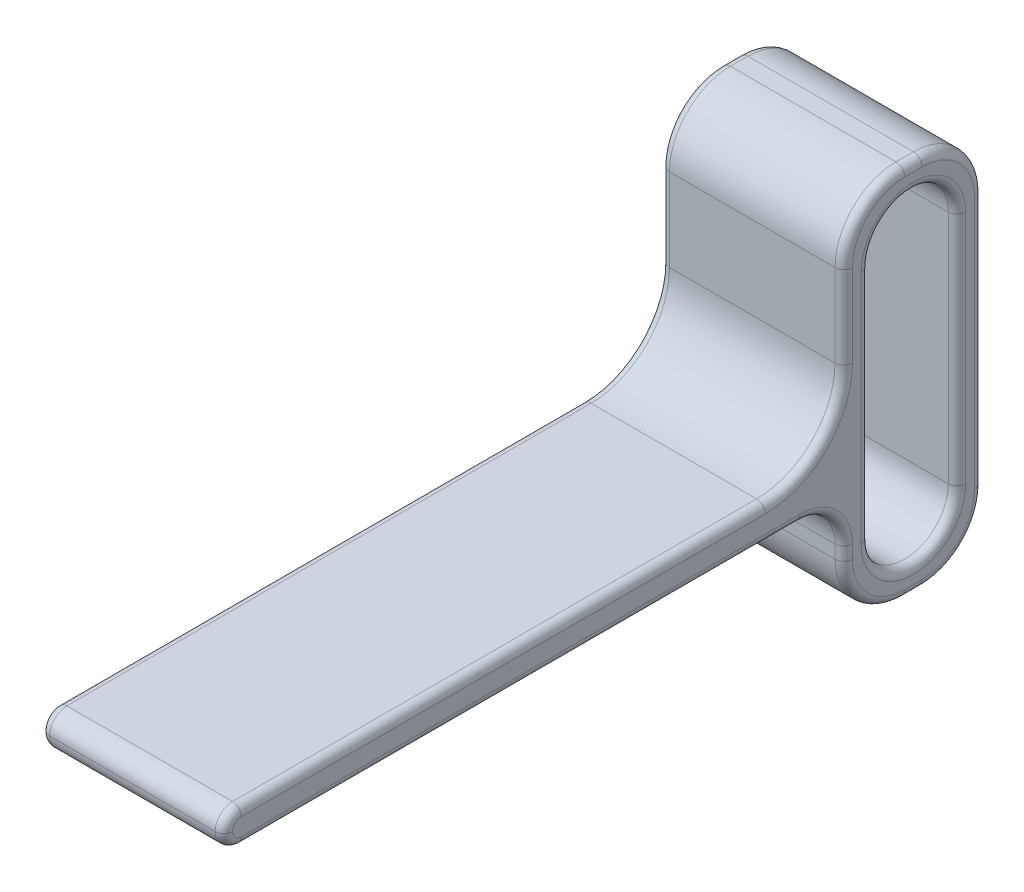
ISO-10303-21;
HEADER;
FILE_DESCRIPTION(('STEP AP214'),'2;1');
FILE_NAME('part.step','',(''),(''),'','','');
FILE_SCHEMA(('AUTOMOTIVE_DESIGN { 1 0 10303 214 1 1 1 1 }'));
ENDSEC;
DATA;
#1=APPLICATION_CONTEXT('core data for automotive mechanical design processes');
#2=APPLICATION_PROTOCOL_DEFINITION('international standard','automotive_design',2000,#1);
#3=PRODUCT_CONTEXT('',#1,'mechanical');
#4=PRODUCT('Part','Part','',(#3));
#5=PRODUCT_RELATED_PRODUCT_CATEGORY('part','',(#4));
#6=PRODUCT_DEFINITION_FORMATION('','',#4);
#7=PRODUCT_DEFINITION_CONTEXT('part definition',#1,'design');
#8=PRODUCT_DEFINITION('design','',#6,#7);
#9=PRODUCT_DEFINITION_SHAPE('','',#8);
#10=(LENGTH_UNIT() NAMED_UNIT(*) SI_UNIT(.MILLI.,.METRE.));
#11=(NAMED_UNIT(*) PLANE_ANGLE_UNIT() SI_UNIT($,.RADIAN.));
#12=(NAMED_UNIT(*) SI_UNIT($,.STERADIAN.) SOLID_ANGLE_UNIT());
#13=UNCERTAINTY_MEASURE_WITH_UNIT(LENGTH_MEASURE(1.E-05),#10,'distance_accuracy_value','');
#14=(GEOMETRIC_REPRESENTATION_CONTEXT(3) GLOBAL_UNCERTAINTY_ASSIGNED_CONTEXT((#13)) GLOBAL_UNIT_ASSIGNED_CONTEXT((#10,
#11,#12)) REPRESENTATION_CONTEXT('',''));
#15=CARTESIAN_POINT('',(0.,0.,0.));
#16=DIRECTION('',(0.,0.,1.));
#17=DIRECTION('',(1.,0.,0.));
#18=AXIS2_PLACEMENT_3D('',#15,#16,#17);
#19=CARTESIAN_POINT('',(10.5,3.,60.));
#20=DIRECTION('',(-1.,0.,0.));
#21=DIRECTION('',(0.,0.,1.));
#22=AXIS2_PLACEMENT_3D('',#19,#20,#21);
#23=PLANE('',#22);
#24=DIRECTION('',(0.,-1.,0.));
#25=VECTOR('',#24,1.);
#26=CARTESIAN_POINT('',(10.5,3.,-13.1547005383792));
#27=LINE('',#26,#25);
#28=CARTESIAN_POINT('',(10.5,-6.5,-13.1547005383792));
#29=VERTEX_POINT('',#28);
#30=CARTESIAN_POINT('',(10.5,20.5,-13.1547005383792));
#31=VERTEX_POINT('',#30);
#32=EDGE_CURVE('E451',#29,#31,#27,.F.);
#33=ORIENTED_EDGE('',*,*,#32,.T.);
#34=CARTESIAN_POINT('',(10.5,20.5,-19.1547005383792));
#35=DIRECTION('',(-1.,0.,0.));
#36=DIRECTION('',(0.,0.,1.));
#37=AXIS2_PLACEMENT_3D('',#34,#35,#36);
#38=CIRCLE('',#37,6.);
#39=CARTESIAN_POINT('',(10.5,20.5,-25.1547005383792));
#40=VERTEX_POINT('',#39);
#41=EDGE_CURVE('E457',#31,#40,#38,.T.);
#42=ORIENTED_EDGE('',*,*,#41,.T.);
#43=DIRECTION('',(0.,1.,0.));
#44=VECTOR('',#43,1.);
#45=CARTESIAN_POINT('',(10.5,3.,-25.1547005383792));
#46=LINE('',#45,#44);
#47=CARTESIAN_POINT('',(10.5,-6.5,-25.1547005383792));
#48=VERTEX_POINT('',#47);
#49=EDGE_CURVE('E455',#40,#48,#46,.F.);
#50=ORIENTED_EDGE('',*,*,#49,.T.);
#51=CARTESIAN_POINT('',(10.5,-6.5,-19.1547005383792));
#52=DIRECTION('',(-1.,0.,0.));
#53=DIRECTION('',(0.,0.,1.));
#54=AXIS2_PLACEMENT_3D('',#51,#52,#53);
#55=CIRCLE('',#54,6.);
#56=EDGE_CURVE('E453',#48,#29,#55,.T.);
#57=ORIENTED_EDGE('',*,*,#56,.T.);
#58=EDGE_LOOP('',(#33,#42,#50,#57));
#59=FACE_BOUND('',#58,.T.);
#60=DIRECTION('',(0.,0.,-1.));
#61=VECTOR('',#60,1.);
#62=CARTESIAN_POINT('',(10.5,2.,60.));
#63=LINE('',#62,#61);
#64=CARTESIAN_POINT('',(10.5,2.,-2.15470053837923));
#65=VERTEX_POINT('',#64);
#66=CARTESIAN_POINT('',(10.5,2.,58.));
#67=VERTEX_POINT('',#66);
#68=EDGE_CURVE('E639',#65,#67,#63,.F.);
#69=ORIENTED_EDGE('',*,*,#68,.T.);
#70=CARTESIAN_POINT('',(10.5,1.,58.));
#71=DIRECTION('',(-1.,0.,0.));
#72=DIRECTION('',(0.,0.,1.));
#73=AXIS2_PLACEMENT_3D('',#70,#71,#72);
#74=CIRCLE('',#73,1.);
#75=CARTESIAN_POINT('',(10.5,1.,59.));
#76=VERTEX_POINT('',#75);
#77=EDGE_CURVE('E448',#67,#76,#74,.F.);
#78=ORIENTED_EDGE('',*,*,#77,.T.);
#79=CARTESIAN_POINT('',(10.5,1.,58.));
#80=DIRECTION('',(-1.,0.,0.));
#81=DIRECTION('',(0.,0.,1.));
#82=AXIS2_PLACEMENT_3D('',#79,#80,#81);
#83=CIRCLE('',#82,1.);
#84=CARTESIAN_POINT('',(10.5,0.,58.));
#85=VERTEX_POINT('',#84);
#86=EDGE_CURVE('E446',#76,#85,#83,.F.);
#87=ORIENTED_EDGE('',*,*,#86,.T.);
#88=DIRECTION('',(0.,0.,1.));
#89=VECTOR('',#88,1.);
#90=CARTESIAN_POINT('',(10.5,0.,-6.15470053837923));
#91=LINE('',#90,#89);
#92=CARTESIAN_POINT('',(10.5,0.,-6.15470053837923));
#93=VERTEX_POINT('',#92);
#94=EDGE_CURVE('E444',#85,#93,#91,.F.);
#95=ORIENTED_EDGE('',*,*,#94,.T.);
#96=CARTESIAN_POINT('',(10.5,-6.,-6.15470053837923));
#97=DIRECTION('',(-1.,0.,0.));
#98=DIRECTION('',(0.,0.,1.));
#99=AXIS2_PLACEMENT_3D('',#96,#97,#98);
#100=CIRCLE('',#99,6.);
#101=CARTESIAN_POINT('',(10.5,-6.,-12.1547005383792));
#102=VERTEX_POINT('',#101);
#103=EDGE_CURVE('E442',#93,#102,#100,.T.);
#104=ORIENTED_EDGE('',*,*,#103,.T.);
#105=DIRECTION('',(0.,-1.,0.));
#106=VECTOR('',#105,1.);
#107=CARTESIAN_POINT('',(10.5,-7.5,-12.1547005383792));
#108=LINE('',#107,#106);
#109=CARTESIAN_POINT('',(10.5,-7.5,-12.1547005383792));
#110=VERTEX_POINT('',#109);
#111=EDGE_CURVE('E440',#102,#110,#108,.T.);
#112=ORIENTED_EDGE('',*,*,#111,.T.);
#113=CARTESIAN_POINT('',(10.5,-7.5,-18.1547005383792));
#114=DIRECTION('',(-1.,0.,0.));
#115=DIRECTION('',(0.,0.,1.));
#116=AXIS2_PLACEMENT_3D('',#113,#114,#115);
#117=CIRCLE('',#116,6.);
#118=CARTESIAN_POINT('',(10.5,-13.5,-18.1547005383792));
#119=VERTEX_POINT('',#118);
#120=EDGE_CURVE('E438',#110,#119,#117,.F.);
#121=ORIENTED_EDGE('',*,*,#120,.T.);
#122=DIRECTION('',(0.,0.,-1.));
#123=VECTOR('',#122,1.);
#124=CARTESIAN_POINT('',(10.5,-13.5,-20.1547005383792));
#125=LINE('',#124,#123);
#126=CARTESIAN_POINT('',(10.5,-13.5,-20.1547005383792));
#127=VERTEX_POINT('',#126);
#128=EDGE_CURVE('E431',#119,#127,#125,.T.);
#129=ORIENTED_EDGE('',*,*,#128,.T.);
#130=CARTESIAN_POINT('',(10.5,-7.5,-20.1547005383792));
#131=DIRECTION('',(-1.,0.,0.));
#132=DIRECTION('',(0.,0.,1.));
#133=AXIS2_PLACEMENT_3D('',#130,#131,#132);
#134=CIRCLE('',#133,6.);
#135=CARTESIAN_POINT('',(10.5,-7.5,-26.1547005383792));
#136=VERTEX_POINT('',#135);
#137=EDGE_CURVE('E421',#127,#136,#134,.F.);
#138=ORIENTED_EDGE('',*,*,#137,.T.);
#139=DIRECTION('',(0.,1.,0.));
#140=VECTOR('',#139,1.);
#141=CARTESIAN_POINT('',(10.5,21.5,-26.1547005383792));
#142=LINE('',#141,#140);
#143=CARTESIAN_POINT('',(10.5,21.5,-26.1547005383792));
#144=VERTEX_POINT('',#143);
#145=EDGE_CURVE('E427',#136,#144,#142,.T.);
#146=ORIENTED_EDGE('',*,*,#145,.T.);
#147=CARTESIAN_POINT('',(10.5,21.5,-20.1547005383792));
#148=DIRECTION('',(-1.,0.,0.));
#149=DIRECTION('',(0.,0.,1.));
#150=AXIS2_PLACEMENT_3D('',#147,#148,#149);
#151=CIRCLE('',#150,6.);
#152=CARTESIAN_POINT('',(10.5,27.5,-20.1547005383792));
#153=VERTEX_POINT('',#152);
#154=EDGE_CURVE('E429',#144,#153,#151,.F.);
#155=ORIENTED_EDGE('',*,*,#154,.T.);
#156=DIRECTION('',(0.,0.,1.));
#157=VECTOR('',#156,1.);
#158=CARTESIAN_POINT('',(10.5,27.5,-18.1547005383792));
#159=LINE('',#158,#157);
#160=CARTESIAN_POINT('',(10.5,27.5,-18.1547005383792));
#161=VERTEX_POINT('',#160);
#162=EDGE_CURVE('E433',#153,#161,#159,.T.);
#163=ORIENTED_EDGE('',*,*,#162,.T.);
#164=CARTESIAN_POINT('',(10.5,21.5,-18.1547005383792));
#165=DIRECTION('',(-1.,0.,0.));
#166=DIRECTION('',(0.,0.,1.));
#167=AXIS2_PLACEMENT_3D('',#164,#165,#166);
#168=CIRCLE('',#167,6.);
#169=CARTESIAN_POINT('',(10.5,21.5,-12.1547005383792));
#170=VERTEX_POINT('',#169);
#171=EDGE_CURVE('E645',#161,#170,#168,.F.);
#172=ORIENTED_EDGE('',*,*,#171,.T.);
#173=DIRECTION('',(0.,-1.,0.));
#174=VECTOR('',#173,1.);
#175=CARTESIAN_POINT('',(10.5,12.,-12.1547005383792));
#176=LINE('',#175,#174);
#177=CARTESIAN_POINT('',(10.5,12.,-12.1547005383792));
#178=VERTEX_POINT('',#177);
#179=EDGE_CURVE('E643',#170,#178,#176,.T.);
#180=ORIENTED_EDGE('',*,*,#179,.T.);
#181=CARTESIAN_POINT('',(10.5,12.,-2.15470053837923));
#182=DIRECTION('',(-1.,0.,0.));
#183=DIRECTION('',(0.,0.,1.));
#184=AXIS2_PLACEMENT_3D('',#181,#182,#183);
#185=CIRCLE('',#184,10.);
#186=EDGE_CURVE('E641',#178,#65,#185,.T.);
#187=ORIENTED_EDGE('',*,*,#186,.T.);
#188=EDGE_LOOP('',(#69,#78,#87,#95,#104,#112,#121,#129,#138,#146,#155,#163,#172,#180,#187));
#189=FACE_BOUND('',#188,.T.);
#190=ADVANCED_FACE('F36',(#59,#189),#23,.F.);
#191=CARTESIAN_POINT('',(-10.5,3.,60.));
#192=DIRECTION('',(1.,0.,0.));
#193=DIRECTION('',(0.,0.,-1.));
#194=AXIS2_PLACEMENT_3D('',#191,#192,#193);
#195=PLANE('',#194);
#196=DIRECTION('',(0.,1.,0.));
#197=VECTOR('',#196,1.);
#198=CARTESIAN_POINT('',(-10.5,3.,-13.1547005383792));
#199=LINE('',#198,#197);
#200=CARTESIAN_POINT('',(-10.5,20.5,-13.1547005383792));
#201=VERTEX_POINT('',#200);
#202=CARTESIAN_POINT('',(-10.5,-6.5,-13.1547005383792));
#203=VERTEX_POINT('',#202);
#204=EDGE_CURVE('E320',#201,#203,#199,.F.);
#205=ORIENTED_EDGE('',*,*,#204,.T.);
#206=CARTESIAN_POINT('',(-10.5,-6.5,-19.1547005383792));
#207=DIRECTION('',(1.,0.,0.));
#208=DIRECTION('',(0.,0.,-1.));
#209=AXIS2_PLACEMENT_3D('',#206,#207,#208);
#210=CIRCLE('',#209,6.);
#211=CARTESIAN_POINT('',(-10.5,-6.5,-25.1547005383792));
#212=VERTEX_POINT('',#211);
#213=EDGE_CURVE('E504',#203,#212,#210,.T.);
#214=ORIENTED_EDGE('',*,*,#213,.T.);
#215=DIRECTION('',(0.,-1.,0.));
#216=VECTOR('',#215,1.);
#217=CARTESIAN_POINT('',(-10.5,3.,-25.1547005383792));
#218=LINE('',#217,#216);
#219=CARTESIAN_POINT('',(-10.5,20.5,-25.1547005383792));
#220=VERTEX_POINT('',#219);
#221=EDGE_CURVE('E502',#212,#220,#218,.F.);
#222=ORIENTED_EDGE('',*,*,#221,.T.);
#223=CARTESIAN_POINT('',(-10.5,20.5,-19.1547005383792));
#224=DIRECTION('',(1.,0.,0.));
#225=DIRECTION('',(0.,0.,-1.));
#226=AXIS2_PLACEMENT_3D('',#223,#224,#225);
#227=CIRCLE('',#226,6.);
#228=EDGE_CURVE('E500',#220,#201,#227,.T.);
#229=ORIENTED_EDGE('',*,*,#228,.T.);
#230=EDGE_LOOP('',(#205,#214,#222,#229));
#231=FACE_BOUND('',#230,.T.);
#232=CARTESIAN_POINT('',(-10.5,1.,58.));
#233=DIRECTION('',(1.,0.,0.));
#234=DIRECTION('',(0.,0.,-1.));
#235=AXIS2_PLACEMENT_3D('',#232,#233,#234);
#236=CIRCLE('',#235,1.);
#237=CARTESIAN_POINT('',(-10.5,0.,58.));
#238=VERTEX_POINT('',#237);
#239=CARTESIAN_POINT('',(-10.5,1.,59.));
#240=VERTEX_POINT('',#239);
#241=EDGE_CURVE('E494',#238,#240,#236,.F.);
#242=ORIENTED_EDGE('',*,*,#241,.T.);
#243=CARTESIAN_POINT('',(-10.5,1.,58.));
#244=DIRECTION('',(1.,0.,0.));
#245=DIRECTION('',(0.,0.,-1.));
#246=AXIS2_PLACEMENT_3D('',#243,#244,#245);
#247=CIRCLE('',#246,1.);
#248=CARTESIAN_POINT('',(-10.5,2.,58.));
#249=VERTEX_POINT('',#248);
#250=EDGE_CURVE('E496',#240,#249,#247,.F.);
#251=ORIENTED_EDGE('',*,*,#250,.T.);
#252=DIRECTION('',(0.,0.,-1.));
#253=VECTOR('',#252,1.);
#254=CARTESIAN_POINT('',(-10.5,2.,60.));
#255=LINE('',#254,#253);
#256=CARTESIAN_POINT('',(-10.5,2.,-2.15470053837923));
#257=VERTEX_POINT('',#256);
#258=EDGE_CURVE('E468',#249,#257,#255,.T.);
#259=ORIENTED_EDGE('',*,*,#258,.T.);
#260=CARTESIAN_POINT('',(-10.5,12.,-2.15470053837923));
#261=DIRECTION('',(1.,0.,0.));
#262=DIRECTION('',(0.,0.,-1.));
#263=AXIS2_PLACEMENT_3D('',#260,#261,#262);
#264=CIRCLE('',#263,10.);
#265=CARTESIAN_POINT('',(-10.5,12.,-12.1547005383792));
#266=VERTEX_POINT('',#265);
#267=EDGE_CURVE('E470',#257,#266,#264,.T.);
#268=ORIENTED_EDGE('',*,*,#267,.T.);
#269=DIRECTION('',(0.,1.,0.));
#270=VECTOR('',#269,1.);
#271=CARTESIAN_POINT('',(-10.5,21.5,-12.1547005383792));
#272=LINE('',#271,#270);
#273=CARTESIAN_POINT('',(-10.5,21.5,-12.1547005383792));
#274=VERTEX_POINT('',#273);
#275=EDGE_CURVE('E472',#266,#274,#272,.T.);
#276=ORIENTED_EDGE('',*,*,#275,.T.);
#277=CARTESIAN_POINT('',(-10.5,21.5,-18.1547005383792));
#278=DIRECTION('',(1.,0.,0.));
#279=DIRECTION('',(0.,0.,-1.));
#280=AXIS2_PLACEMENT_3D('',#277,#278,#279);
#281=CIRCLE('',#280,6.);
#282=CARTESIAN_POINT('',(-10.5,27.5,-18.1547005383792));
#283=VERTEX_POINT('',#282);
#284=EDGE_CURVE('E474',#274,#283,#281,.F.);
#285=ORIENTED_EDGE('',*,*,#284,.T.);
#286=DIRECTION('',(0.,0.,-1.));
#287=VECTOR('',#286,1.);
#288=CARTESIAN_POINT('',(-10.5,27.5,-20.1547005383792));
#289=LINE('',#288,#287);
#290=CARTESIAN_POINT('',(-10.5,27.5,-20.1547005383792));
#291=VERTEX_POINT('',#290);
#292=EDGE_CURVE('E476',#283,#291,#289,.T.);
#293=ORIENTED_EDGE('',*,*,#292,.T.);
#294=CARTESIAN_POINT('',(-10.5,21.5,-20.1547005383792));
#295=DIRECTION('',(1.,0.,0.));
#296=DIRECTION('',(0.,0.,-1.));
#297=AXIS2_PLACEMENT_3D('',#294,#295,#296);
#298=CIRCLE('',#297,6.);
#299=CARTESIAN_POINT('',(-10.5,21.5,-26.1547005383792));
#300=VERTEX_POINT('',#299);
#301=EDGE_CURVE('E478',#291,#300,#298,.F.);
#302=ORIENTED_EDGE('',*,*,#301,.T.);
#303=DIRECTION('',(0.,-1.,0.));
#304=VECTOR('',#303,1.);
#305=CARTESIAN_POINT('',(-10.5,-7.5,-26.1547005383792));
#306=LINE('',#305,#304);
#307=CARTESIAN_POINT('',(-10.5,-7.5,-26.1547005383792));
#308=VERTEX_POINT('',#307);
#309=EDGE_CURVE('E480',#300,#308,#306,.T.);
#310=ORIENTED_EDGE('',*,*,#309,.T.);
#311=CARTESIAN_POINT('',(-10.5,-7.5,-20.1547005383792));
#312=DIRECTION('',(1.,0.,0.));
#313=DIRECTION('',(0.,0.,-1.));
#314=AXIS2_PLACEMENT_3D('',#311,#312,#313);
#315=CIRCLE('',#314,6.);
#316=CARTESIAN_POINT('',(-10.5,-13.5,-20.1547005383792));
#317=VERTEX_POINT('',#316);
#318=EDGE_CURVE('E482',#308,#317,#315,.F.);
#319=ORIENTED_EDGE('',*,*,#318,.T.);
#320=DIRECTION('',(0.,0.,1.));
#321=VECTOR('',#320,1.);
#322=CARTESIAN_POINT('',(-10.5,-13.5,-18.1547005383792));
#323=LINE('',#322,#321);
#324=CARTESIAN_POINT('',(-10.5,-13.5,-18.1547005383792));
#325=VERTEX_POINT('',#324);
#326=EDGE_CURVE('E484',#317,#325,#323,.T.);
#327=ORIENTED_EDGE('',*,*,#326,.T.);
#328=CARTESIAN_POINT('',(-10.5,-7.5,-18.1547005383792));
#329=DIRECTION('',(1.,0.,0.));
#330=DIRECTION('',(0.,0.,-1.));
#331=AXIS2_PLACEMENT_3D('',#328,#329,#330);
#332=CIRCLE('',#331,6.);
#333=CARTESIAN_POINT('',(-10.5,-7.5,-12.1547005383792));
#334=VERTEX_POINT('',#333);
#335=EDGE_CURVE('E486',#325,#334,#332,.F.);
#336=ORIENTED_EDGE('',*,*,#335,.T.);
#337=DIRECTION('',(0.,1.,0.));
#338=VECTOR('',#337,1.);
#339=CARTESIAN_POINT('',(-10.5,-6.,-12.1547005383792));
#340=LINE('',#339,#338);
#341=CARTESIAN_POINT('',(-10.5,-6.,-12.1547005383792));
#342=VERTEX_POINT('',#341);
#343=EDGE_CURVE('E488',#334,#342,#340,.T.);
#344=ORIENTED_EDGE('',*,*,#343,.T.);
#345=CARTESIAN_POINT('',(-10.5,-6.,-6.15470053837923));
#346=DIRECTION('',(1.,0.,0.));
#347=DIRECTION('',(0.,0.,-1.));
#348=AXIS2_PLACEMENT_3D('',#345,#346,#347);
#349=CIRCLE('',#348,6.);
#350=CARTESIAN_POINT('',(-10.5,0.,-6.15470053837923));
#351=VERTEX_POINT('',#350);
#352=EDGE_CURVE('E490',#342,#351,#349,.T.);
#353=ORIENTED_EDGE('',*,*,#352,.T.);
#354=DIRECTION('',(0.,0.,-1.));
#355=VECTOR('',#354,1.);
#356=CARTESIAN_POINT('',(-10.5,0.,58.));
#357=LINE('',#356,#355);
#358=EDGE_CURVE('E492',#351,#238,#357,.F.);
#359=ORIENTED_EDGE('',*,*,#358,.T.);
#360=EDGE_LOOP('',(#242,#251,#259,#268,#276,#285,#293,#302,#310,#319,#327,#336,#344,#353,#359));
#361=FACE_BOUND('',#360,.T.);
#362=ADVANCED_FACE('F579',(#231,#361),#195,.F.);
#363=CARTESIAN_POINT('',(-10.5,3.,60.));
#364=DIRECTION('',(0.,-1.,0.));
#365=DIRECTION('',(0.,0.,-1.));
#366=AXIS2_PLACEMENT_3D('',#363,#364,#365);
#367=PLANE('',#366);
#368=DIRECTION('',(1.,0.,0.));
#369=VECTOR('',#368,1.);
#370=CARTESIAN_POINT('',(-10.5,3.,-2.15470053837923));
#371=LINE('',#370,#369);
#372=CARTESIAN_POINT('',(9.5,3.,-2.15470053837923));
#373=VERTEX_POINT('',#372);
#374=CARTESIAN_POINT('',(-9.50000000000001,3.,-2.15470053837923));
#375=VERTEX_POINT('',#374);
#376=EDGE_CURVE('E630',#373,#375,#371,.F.);
#377=ORIENTED_EDGE('',*,*,#376,.T.);
#378=DIRECTION('',(0.,0.,-1.));
#379=VECTOR('',#378,1.);
#380=CARTESIAN_POINT('',(-9.50000000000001,3.,60.));
#381=LINE('',#380,#379);
#382=CARTESIAN_POINT('',(-9.50000000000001,3.,58.));
#383=VERTEX_POINT('',#382);
#384=EDGE_CURVE('E11',#375,#383,#381,.F.);
#385=ORIENTED_EDGE('',*,*,#384,.T.);
#386=DIRECTION('',(-1.,0.,0.));
#387=VECTOR('',#386,1.);
#388=CARTESIAN_POINT('',(10.5,3.,58.));
#389=LINE('',#388,#387);
#390=CARTESIAN_POINT('',(9.5,3.,58.));
#391=VERTEX_POINT('',#390);
#392=EDGE_CURVE('E317',#383,#391,#389,.F.);
#393=ORIENTED_EDGE('',*,*,#392,.T.);
#394=DIRECTION('',(0.,0.,-1.));
#395=VECTOR('',#394,1.);
#396=CARTESIAN_POINT('',(9.5,3.,60.));
#397=LINE('',#396,#395);
#398=EDGE_CURVE('E45',#391,#373,#397,.T.);
#399=ORIENTED_EDGE('',*,*,#398,.T.);
#400=EDGE_LOOP('',(#377,#385,#393,#399));
#401=FACE_BOUND('',#400,.T.);
#402=ADVANCED_FACE('F818',(#401),#367,.F.);
#403=CARTESIAN_POINT('',(0.,-1.,0.));
#404=DIRECTION('',(0.,-1.,0.));
#405=DIRECTION('',(0.,0.,-1.));
#406=AXIS2_PLACEMENT_3D('',#403,#404,#405);
#407=PLANE('',#406);
#408=DIRECTION('',(-1.,0.,0.));
#409=VECTOR('',#408,1.);
#410=CARTESIAN_POINT('',(0.,-1.,58.));
#411=LINE('',#410,#409);
#412=CARTESIAN_POINT('',(9.5,-1.,58.));
#413=VERTEX_POINT('',#412);
#414=CARTESIAN_POINT('',(-9.50000000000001,-1.,58.));
#415=VERTEX_POINT('',#414);
#416=EDGE_CURVE('E632',#413,#415,#411,.T.);
#417=ORIENTED_EDGE('',*,*,#416,.T.);
#418=DIRECTION('',(0.,0.,-1.));
#419=VECTOR('',#418,1.);
#420=CARTESIAN_POINT('',(-9.50000000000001,-1.,-6.15470053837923));
#421=LINE('',#420,#419);
#422=CARTESIAN_POINT('',(-9.50000000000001,-1.,-6.15470053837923));
#423=VERTEX_POINT('',#422);
#424=EDGE_CURVE('E519',#415,#423,#421,.T.);
#425=ORIENTED_EDGE('',*,*,#424,.T.);
#426=DIRECTION('',(1.,0.,0.));
#427=VECTOR('',#426,1.);
#428=CARTESIAN_POINT('',(10.5,-1.,-6.15470053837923));
#429=LINE('',#428,#427);
#430=CARTESIAN_POINT('',(9.5,-1.,-6.15470053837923));
#431=VERTEX_POINT('',#430);
#432=EDGE_CURVE('E621',#423,#431,#429,.T.);
#433=ORIENTED_EDGE('',*,*,#432,.T.);
#434=DIRECTION('',(0.,0.,1.));
#435=VECTOR('',#434,1.);
#436=CARTESIAN_POINT('',(9.5,-1.,58.));
#437=LINE('',#436,#435);
#438=EDGE_CURVE('E517',#431,#413,#437,.T.);
#439=ORIENTED_EDGE('',*,*,#438,.T.);
#440=EDGE_LOOP('',(#417,#425,#433,#439));
#441=FACE_BOUND('',#440,.T.);
#442=ADVANCED_FACE('F714',(#441),#407,.T.);
#443=CARTESIAN_POINT('',(-56.3802789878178,28.5,-11.1547005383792));
#444=DIRECTION('',(0.,0.,1.));
#445=DIRECTION('',(1.,0.,0.));
#446=AXIS2_PLACEMENT_3D('',#443,#444,#445);
#447=PLANE('',#446);
#448=DIRECTION('',(1.,0.,0.));
#449=VECTOR('',#448,1.);
#450=CARTESIAN_POINT('',(-10.5,-6.,-11.1547005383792));
#451=LINE('',#450,#449);
#452=CARTESIAN_POINT('',(9.5,-6.,-11.1547005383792));
#453=VERTEX_POINT('',#452);
#454=CARTESIAN_POINT('',(-9.50000000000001,-6.,-11.1547005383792));
#455=VERTEX_POINT('',#454);
#456=EDGE_CURVE('E624',#453,#455,#451,.F.);
#457=ORIENTED_EDGE('',*,*,#456,.T.);
#458=DIRECTION('',(0.,1.,0.));
#459=VECTOR('',#458,1.);
#460=CARTESIAN_POINT('',(-9.50000000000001,-7.5,-11.1547005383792));
#461=LINE('',#460,#459);
#462=CARTESIAN_POINT('',(-9.50000000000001,-7.5,-11.1547005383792));
#463=VERTEX_POINT('',#462);
#464=EDGE_CURVE('E527',#455,#463,#461,.F.);
#465=ORIENTED_EDGE('',*,*,#464,.T.);
#466=DIRECTION('',(1.,0.,0.));
#467=VECTOR('',#466,1.);
#468=CARTESIAN_POINT('',(-56.3802789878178,-7.5,-11.1547005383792));
#469=LINE('',#468,#467);
#470=CARTESIAN_POINT('',(9.49999999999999,-7.5,-11.1547005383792));
#471=VERTEX_POINT('',#470);
#472=EDGE_CURVE('E609',#463,#471,#469,.T.);
#473=ORIENTED_EDGE('',*,*,#472,.T.);
#474=DIRECTION('',(0.,-1.,0.));
#475=VECTOR('',#474,1.);
#476=CARTESIAN_POINT('',(9.5,-6.,-11.1547005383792));
#477=LINE('',#476,#475);
#478=EDGE_CURVE('E525',#471,#453,#477,.F.);
#479=ORIENTED_EDGE('',*,*,#478,.T.);
#480=EDGE_LOOP('',(#457,#465,#473,#479));
#481=FACE_BOUND('',#480,.T.);
#482=ADVANCED_FACE('F730',(#481),#447,.T.);
#483=CARTESIAN_POINT('',(-56.3802789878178,-14.5,-11.1547005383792));
#484=DIRECTION('',(0.,-1.,0.));
#485=DIRECTION('',(0.,0.,-1.));
#486=AXIS2_PLACEMENT_3D('',#483,#484,#485);
#487=PLANE('',#486);
#488=DIRECTION('',(1.,0.,0.));
#489=VECTOR('',#488,1.);
#490=CARTESIAN_POINT('',(-56.3802789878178,-14.5,-18.1547005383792));
#491=LINE('',#490,#489);
#492=CARTESIAN_POINT('',(9.49999999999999,-14.5,-18.1547005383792));
#493=VERTEX_POINT('',#492);
#494=CARTESIAN_POINT('',(-9.50000000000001,-14.5,-18.1547005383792));
#495=VERTEX_POINT('',#494);
#496=EDGE_CURVE('E594',#493,#495,#491,.F.);
#497=ORIENTED_EDGE('',*,*,#496,.T.);
#498=DIRECTION('',(0.,0.,1.));
#499=VECTOR('',#498,1.);
#500=CARTESIAN_POINT('',(-9.50000000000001,-14.5,-20.1547005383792));
#501=LINE('',#500,#499);
#502=CARTESIAN_POINT('',(-9.50000000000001,-14.5,-20.1547005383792));
#503=VERTEX_POINT('',#502);
#504=EDGE_CURVE('E535',#495,#503,#501,.F.);
#505=ORIENTED_EDGE('',*,*,#504,.T.);
#506=DIRECTION('',(1.,0.,0.));
#507=VECTOR('',#506,1.);
#508=CARTESIAN_POINT('',(-56.3802789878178,-14.5,-20.1547005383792));
#509=LINE('',#508,#507);
#510=CARTESIAN_POINT('',(9.49999999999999,-14.5,-20.1547005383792));
#511=VERTEX_POINT('',#510);
#512=EDGE_CURVE('E600',#503,#511,#509,.T.);
#513=ORIENTED_EDGE('',*,*,#512,.T.);
#514=DIRECTION('',(0.,0.,-1.));
#515=VECTOR('',#514,1.);
#516=CARTESIAN_POINT('',(9.5,-14.5,-18.1547005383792));
#517=LINE('',#516,#515);
#518=EDGE_CURVE('E533',#511,#493,#517,.F.);
#519=ORIENTED_EDGE('',*,*,#518,.T.);
#520=EDGE_LOOP('',(#497,#505,#513,#519));
#521=FACE_BOUND('',#520,.T.);
#522=ADVANCED_FACE('F748',(#521),#487,.T.);
#523=CARTESIAN_POINT('',(-56.3802789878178,28.5,-27.1547005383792));
#524=DIRECTION('',(0.,0.,-1.));
#525=DIRECTION('',(0.,1.,0.));
#526=AXIS2_PLACEMENT_3D('',#523,#524,#525);
#527=PLANE('',#526);
#528=DIRECTION('',(1.,0.,0.));
#529=VECTOR('',#528,1.);
#530=CARTESIAN_POINT('',(-56.3802789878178,-7.5,-27.1547005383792));
#531=LINE('',#530,#529);
#532=CARTESIAN_POINT('',(9.49999999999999,-7.5,-27.1547005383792));
#533=VERTEX_POINT('',#532);
#534=CARTESIAN_POINT('',(-9.50000000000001,-7.5,-27.1547005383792));
#535=VERTEX_POINT('',#534);
#536=EDGE_CURVE('E606',#533,#535,#531,.F.);
#537=ORIENTED_EDGE('',*,*,#536,.T.);
#538=DIRECTION('',(0.,-1.,0.));
#539=VECTOR('',#538,1.);
#540=CARTESIAN_POINT('',(-9.50000000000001,21.5,-27.1547005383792));
#541=LINE('',#540,#539);
#542=CARTESIAN_POINT('',(-9.50000000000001,21.5,-27.1547005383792));
#543=VERTEX_POINT('',#542);
#544=EDGE_CURVE('E541',#535,#543,#541,.F.);
#545=ORIENTED_EDGE('',*,*,#544,.T.);
#546=DIRECTION('',(1.,0.,0.));
#547=VECTOR('',#546,1.);
#548=CARTESIAN_POINT('',(-56.3802789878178,21.5,-27.1547005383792));
#549=LINE('',#548,#547);
#550=CARTESIAN_POINT('',(9.49999999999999,21.5,-27.1547005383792));
#551=VERTEX_POINT('',#550);
#552=EDGE_CURVE('E603',#543,#551,#549,.T.);
#553=ORIENTED_EDGE('',*,*,#552,.T.);
#554=DIRECTION('',(0.,1.,0.));
#555=VECTOR('',#554,1.);
#556=CARTESIAN_POINT('',(9.5,-7.5,-27.1547005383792));
#557=LINE('',#556,#555);
#558=EDGE_CURVE('E426',#551,#533,#557,.F.);
#559=ORIENTED_EDGE('',*,*,#558,.T.);
#560=EDGE_LOOP('',(#537,#545,#553,#559));
#561=FACE_BOUND('',#560,.T.);
#562=ADVANCED_FACE('F765',(#561),#527,.T.);
#563=CARTESIAN_POINT('',(-56.3802789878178,28.5,-11.1547005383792));
#564=DIRECTION('',(0.,1.,0.));
#565=DIRECTION('',(0.,0.,1.));
#566=AXIS2_PLACEMENT_3D('',#563,#564,#565);
#567=PLANE('',#566);
#568=DIRECTION('',(1.,0.,0.));
#569=VECTOR('',#568,1.);
#570=CARTESIAN_POINT('',(-56.3802789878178,28.5,-20.1547005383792));
#571=LINE('',#570,#569);
#572=CARTESIAN_POINT('',(9.49999999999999,28.5,-20.1547005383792));
#573=VERTEX_POINT('',#572);
#574=CARTESIAN_POINT('',(-9.50000000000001,28.5,-20.1547005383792));
#575=VERTEX_POINT('',#574);
#576=EDGE_CURVE('E615',#573,#575,#571,.F.);
#577=ORIENTED_EDGE('',*,*,#576,.T.);
#578=DIRECTION('',(0.,0.,-1.));
#579=VECTOR('',#578,1.);
#580=CARTESIAN_POINT('',(-9.50000000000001,28.5,-18.1547005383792));
#581=LINE('',#580,#579);
#582=CARTESIAN_POINT('',(-9.50000000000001,28.5,-18.1547005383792));
#583=VERTEX_POINT('',#582);
#584=EDGE_CURVE('E549',#575,#583,#581,.F.);
#585=ORIENTED_EDGE('',*,*,#584,.T.);
#586=DIRECTION('',(1.,0.,0.));
#587=VECTOR('',#586,1.);
#588=CARTESIAN_POINT('',(-56.3802789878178,28.5,-18.1547005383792));
#589=LINE('',#588,#587);
#590=CARTESIAN_POINT('',(9.49999999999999,28.5,-18.1547005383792));
#591=VERTEX_POINT('',#590);
#592=EDGE_CURVE('E612',#583,#591,#589,.T.);
#593=ORIENTED_EDGE('',*,*,#592,.T.);
#594=DIRECTION('',(0.,0.,1.));
#595=VECTOR('',#594,1.);
#596=CARTESIAN_POINT('',(9.5,28.5,-20.1547005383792));
#597=LINE('',#596,#595);
#598=EDGE_CURVE('E547',#591,#573,#597,.F.);
#599=ORIENTED_EDGE('',*,*,#598,.T.);
#600=EDGE_LOOP('',(#577,#585,#593,#599));
#601=FACE_BOUND('',#600,.T.);
#602=ADVANCED_FACE('F787',(#601),#567,.T.);
#603=DIRECTION('',(1.,0.,0.));
#604=VECTOR('',#603,1.);
#605=CARTESIAN_POINT('',(-56.3802789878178,21.5,-11.1547005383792));
#606=LINE('',#605,#604);
#607=CARTESIAN_POINT('',(9.49999999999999,21.5,-11.1547005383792));
#608=VERTEX_POINT('',#607);
#609=CARTESIAN_POINT('',(-9.50000000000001,21.5,-11.1547005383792));
#610=VERTEX_POINT('',#609);
#611=EDGE_CURVE('E618',#608,#610,#606,.F.);
#612=ORIENTED_EDGE('',*,*,#611,.T.);
#613=DIRECTION('',(0.,1.,0.));
#614=VECTOR('',#613,1.);
#615=CARTESIAN_POINT('',(-9.50000000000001,12.,-11.1547005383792));
#616=LINE('',#615,#614);
#617=CARTESIAN_POINT('',(-9.50000000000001,12.,-11.1547005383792));
#618=VERTEX_POINT('',#617);
#619=EDGE_CURVE('E557',#610,#618,#616,.F.);
#620=ORIENTED_EDGE('',*,*,#619,.T.);
#621=DIRECTION('',(1.,0.,0.));
#622=VECTOR('',#621,1.);
#623=CARTESIAN_POINT('',(-56.3802789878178,12.,-11.1547005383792));
#624=LINE('',#623,#622);
#625=CARTESIAN_POINT('',(9.49999999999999,12.,-11.1547005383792));
#626=VERTEX_POINT('',#625);
#627=EDGE_CURVE('E627',#618,#626,#624,.T.);
#628=ORIENTED_EDGE('',*,*,#627,.T.);
#629=DIRECTION('',(0.,-1.,0.));
#630=VECTOR('',#629,1.);
#631=CARTESIAN_POINT('',(9.5,21.5,-11.1547005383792));
#632=LINE('',#631,#630);
#633=EDGE_CURVE('E555',#626,#608,#632,.F.);
#634=ORIENTED_EDGE('',*,*,#633,.T.);
#635=EDGE_LOOP('',(#612,#620,#628,#634));
#636=FACE_BOUND('',#635,.T.);
#637=ADVANCED_FACE('F793',(#636),#447,.T.);
#638=CARTESIAN_POINT('',(-56.3802789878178,-6.5,-14.1547005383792));
#639=DIRECTION('',(0.,0.,1.));
#640=DIRECTION('',(1.,0.,0.));
#641=AXIS2_PLACEMENT_3D('',#638,#639,#640);
#642=PLANE('',#641);
#643=DIRECTION('',(1.,0.,0.));
#644=VECTOR('',#643,1.);
#645=CARTESIAN_POINT('',(-56.3802789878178,20.5,-14.1547005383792));
#646=LINE('',#645,#644);
#647=CARTESIAN_POINT('',(-9.50000000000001,20.5,-14.1547005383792));
#648=VERTEX_POINT('',#647);
#649=CARTESIAN_POINT('',(9.49999999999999,20.5,-14.1547005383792));
#650=VERTEX_POINT('',#649);
#651=EDGE_CURVE('E287',#648,#650,#646,.T.);
#652=ORIENTED_EDGE('',*,*,#651,.T.);
#653=DIRECTION('',(0.,-1.,0.));
#654=VECTOR('',#653,1.);
#655=CARTESIAN_POINT('',(9.49999999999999,-6.5,-14.1547005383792));
#656=LINE('',#655,#654);
#657=CARTESIAN_POINT('',(9.49999999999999,-6.5,-14.1547005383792));
#658=VERTEX_POINT('',#657);
#659=EDGE_CURVE('E294',#650,#658,#656,.T.);
#660=ORIENTED_EDGE('',*,*,#659,.T.);
#661=DIRECTION('',(1.,0.,0.));
#662=VECTOR('',#661,1.);
#663=CARTESIAN_POINT('',(-56.3802789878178,-6.5,-14.1547005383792));
#664=LINE('',#663,#662);
#665=CARTESIAN_POINT('',(-9.50000000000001,-6.5,-14.1547005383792));
#666=VERTEX_POINT('',#665);
#667=EDGE_CURVE('E289',#666,#658,#664,.T.);
#668=ORIENTED_EDGE('',*,*,#667,.F.);
#669=DIRECTION('',(0.,1.,0.));
#670=VECTOR('',#669,1.);
#671=CARTESIAN_POINT('',(-9.50000000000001,-6.5,-14.1547005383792));
#672=LINE('',#671,#670);
#673=EDGE_CURVE('E284',#666,#648,#672,.T.);
#674=ORIENTED_EDGE('',*,*,#673,.T.);
#675=EDGE_LOOP('',(#652,#660,#668,#674));
#676=FACE_BOUND('',#675,.T.);
#677=ADVANCED_FACE('F286',(#676),#642,.F.);
#678=CARTESIAN_POINT('',(-56.3802789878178,-6.5,-19.1547005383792));
#679=DIRECTION('',(1.,0.,0.));
#680=DIRECTION('',(0.,0.,-1.));
#681=AXIS2_PLACEMENT_3D('',#678,#679,#680);
#682=CYLINDRICAL_SURFACE('',#681,5.);
#683=ORIENTED_EDGE('',*,*,#667,.T.);
#684=CARTESIAN_POINT('',(9.49999999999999,-6.5,-19.1547005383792));
#685=DIRECTION('',(-1.,0.,0.));
#686=DIRECTION('',(0.,0.,1.));
#687=AXIS2_PLACEMENT_3D('',#684,#685,#686);
#688=CIRCLE('',#687,5.);
#689=CARTESIAN_POINT('',(9.49999999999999,-6.5,-24.1547005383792));
#690=VERTEX_POINT('',#689);
#691=EDGE_CURVE('E466',#658,#690,#688,.F.);
#692=ORIENTED_EDGE('',*,*,#691,.T.);
#693=DIRECTION('',(1.,0.,0.));
#694=VECTOR('',#693,1.);
#695=CARTESIAN_POINT('',(-56.3802789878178,-6.5,-24.1547005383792));
#696=LINE('',#695,#694);
#697=CARTESIAN_POINT('',(-9.50000000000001,-6.5,-24.1547005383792));
#698=VERTEX_POINT('',#697);
#699=EDGE_CURVE('E587',#698,#690,#696,.T.);
#700=ORIENTED_EDGE('',*,*,#699,.F.);
#701=CARTESIAN_POINT('',(-9.50000000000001,-6.5,-19.1547005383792));
#702=DIRECTION('',(1.,0.,0.));
#703=DIRECTION('',(0.,0.,-1.));
#704=AXIS2_PLACEMENT_3D('',#701,#702,#703);
#705=CIRCLE('',#704,5.);
#706=EDGE_CURVE('E464',#698,#666,#705,.F.);
#707=ORIENTED_EDGE('',*,*,#706,.T.);
#708=EDGE_LOOP('',(#683,#692,#700,#707));
#709=FACE_BOUND('',#708,.T.);
#710=ADVANCED_FACE('F591',(#709),#682,.F.);
#711=CARTESIAN_POINT('',(-56.3802789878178,-6.5,-24.1547005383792));
#712=DIRECTION('',(0.,0.,-1.));
#713=DIRECTION('',(-1.,0.,0.));
#714=AXIS2_PLACEMENT_3D('',#711,#712,#713);
#715=PLANE('',#714);
#716=ORIENTED_EDGE('',*,*,#699,.T.);
#717=DIRECTION('',(0.,1.,0.));
#718=VECTOR('',#717,1.);
#719=CARTESIAN_POINT('',(9.49999999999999,-6.5,-24.1547005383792));
#720=LINE('',#719,#718);
#721=CARTESIAN_POINT('',(9.49999999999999,20.5,-24.1547005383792));
#722=VERTEX_POINT('',#721);
#723=EDGE_CURVE('E462',#690,#722,#720,.T.);
#724=ORIENTED_EDGE('',*,*,#723,.T.);
#725=DIRECTION('',(1.,0.,0.));
#726=VECTOR('',#725,1.);
#727=CARTESIAN_POINT('',(-56.3802789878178,20.5,-24.1547005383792));
#728=LINE('',#727,#726);
#729=CARTESIAN_POINT('',(-9.50000000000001,20.5,-24.1547005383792));
#730=VERTEX_POINT('',#729);
#731=EDGE_CURVE('E589',#730,#722,#728,.T.);
#732=ORIENTED_EDGE('',*,*,#731,.F.);
#733=DIRECTION('',(0.,-1.,0.));
#734=VECTOR('',#733,1.);
#735=CARTESIAN_POINT('',(-9.50000000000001,-6.5,-24.1547005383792));
#736=LINE('',#735,#734);
#737=EDGE_CURVE('E460',#730,#698,#736,.T.);
#738=ORIENTED_EDGE('',*,*,#737,.T.);
#739=EDGE_LOOP('',(#716,#724,#732,#738));
#740=FACE_BOUND('',#739,.T.);
#741=ADVANCED_FACE('F586',(#740),#715,.F.);
#742=CARTESIAN_POINT('',(-56.3802789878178,20.5,-19.1547005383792));
#743=DIRECTION('',(1.,0.,0.));
#744=DIRECTION('',(0.,0.,-1.));
#745=AXIS2_PLACEMENT_3D('',#742,#743,#744);
#746=CYLINDRICAL_SURFACE('',#745,5.);
#747=ORIENTED_EDGE('',*,*,#731,.T.);
#748=CARTESIAN_POINT('',(9.49999999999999,20.5,-19.1547005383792));
#749=DIRECTION('',(-1.,0.,0.));
#750=DIRECTION('',(0.,0.,1.));
#751=AXIS2_PLACEMENT_3D('',#748,#749,#750);
#752=CIRCLE('',#751,5.);
#753=EDGE_CURVE('E304',#722,#650,#752,.F.);
#754=ORIENTED_EDGE('',*,*,#753,.T.);
#755=ORIENTED_EDGE('',*,*,#651,.F.);
#756=CARTESIAN_POINT('',(-9.50000000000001,20.5,-19.1547005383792));
#757=DIRECTION('',(1.,0.,0.));
#758=DIRECTION('',(0.,0.,-1.));
#759=AXIS2_PLACEMENT_3D('',#756,#757,#758);
#760=CIRCLE('',#759,5.);
#761=EDGE_CURVE('E301',#648,#730,#760,.F.);
#762=ORIENTED_EDGE('',*,*,#761,.T.);
#763=EDGE_LOOP('',(#747,#754,#755,#762));
#764=FACE_BOUND('',#763,.T.);
#765=ADVANCED_FACE('F300',(#764),#746,.F.);
#766=CARTESIAN_POINT('',(-56.3802789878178,-7.5,-20.1547005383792));
#767=DIRECTION('',(1.,0.,0.));
#768=DIRECTION('',(0.,0.,-1.));
#769=AXIS2_PLACEMENT_3D('',#766,#767,#768);
#770=CYLINDRICAL_SURFACE('',#769,7.);
#771=ORIENTED_EDGE('',*,*,#512,.F.);
#772=CARTESIAN_POINT('',(-9.50000000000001,-7.5,-20.1547005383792));
#773=DIRECTION('',(1.,0.,0.));
#774=DIRECTION('',(0.,0.,-1.));
#775=AXIS2_PLACEMENT_3D('',#772,#773,#774);
#776=CIRCLE('',#775,7.);
#777=EDGE_CURVE('E538',#503,#535,#776,.T.);
#778=ORIENTED_EDGE('',*,*,#777,.T.);
#779=ORIENTED_EDGE('',*,*,#536,.F.);
#780=CARTESIAN_POINT('',(9.49999999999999,-7.5,-20.1547005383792));
#781=DIRECTION('',(-1.,0.,0.));
#782=DIRECTION('',(0.,0.,1.));
#783=AXIS2_PLACEMENT_3D('',#780,#781,#782);
#784=CIRCLE('',#783,7.);
#785=EDGE_CURVE('E422',#533,#511,#784,.T.);
#786=ORIENTED_EDGE('',*,*,#785,.T.);
#787=EDGE_LOOP('',(#771,#778,#779,#786));
#788=FACE_BOUND('',#787,.T.);
#789=ADVANCED_FACE('F763',(#788),#770,.T.);
#790=CARTESIAN_POINT('',(-56.3802789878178,-7.5,-18.1547005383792));
#791=DIRECTION('',(1.,0.,0.));
#792=DIRECTION('',(0.,0.,-1.));
#793=AXIS2_PLACEMENT_3D('',#790,#791,#792);
#794=CYLINDRICAL_SURFACE('',#793,7.);
#795=ORIENTED_EDGE('',*,*,#472,.F.);
#796=CARTESIAN_POINT('',(-9.50000000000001,-7.5,-18.1547005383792));
#797=DIRECTION('',(1.,0.,0.));
#798=DIRECTION('',(0.,0.,-1.));
#799=AXIS2_PLACEMENT_3D('',#796,#797,#798);
#800=CIRCLE('',#799,7.);
#801=EDGE_CURVE('E531',#463,#495,#800,.T.);
#802=ORIENTED_EDGE('',*,*,#801,.T.);
#803=ORIENTED_EDGE('',*,*,#496,.F.);
#804=CARTESIAN_POINT('',(9.49999999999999,-7.5,-18.1547005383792));
#805=DIRECTION('',(-1.,0.,0.));
#806=DIRECTION('',(0.,0.,1.));
#807=AXIS2_PLACEMENT_3D('',#804,#805,#806);
#808=CIRCLE('',#807,7.);
#809=EDGE_CURVE('E529',#493,#471,#808,.T.);
#810=ORIENTED_EDGE('',*,*,#809,.T.);
#811=EDGE_LOOP('',(#795,#802,#803,#810));
#812=FACE_BOUND('',#811,.T.);
#813=ADVANCED_FACE('F744',(#812),#794,.T.);
#814=CARTESIAN_POINT('',(-56.3802789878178,21.5,-20.1547005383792));
#815=DIRECTION('',(1.,0.,0.));
#816=DIRECTION('',(0.,0.,-1.));
#817=AXIS2_PLACEMENT_3D('',#814,#815,#816);
#818=CYLINDRICAL_SURFACE('',#817,7.);
#819=ORIENTED_EDGE('',*,*,#552,.F.);
#820=CARTESIAN_POINT('',(-9.50000000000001,21.5,-20.1547005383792));
#821=DIRECTION('',(1.,0.,0.));
#822=DIRECTION('',(0.,0.,-1.));
#823=AXIS2_PLACEMENT_3D('',#820,#821,#822);
#824=CIRCLE('',#823,7.);
#825=EDGE_CURVE('E545',#543,#575,#824,.T.);
#826=ORIENTED_EDGE('',*,*,#825,.T.);
#827=ORIENTED_EDGE('',*,*,#576,.F.);
#828=CARTESIAN_POINT('',(9.49999999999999,21.5,-20.1547005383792));
#829=DIRECTION('',(-1.,0.,0.));
#830=DIRECTION('',(0.,0.,1.));
#831=AXIS2_PLACEMENT_3D('',#828,#829,#830);
#832=CIRCLE('',#831,7.);
#833=EDGE_CURVE('E543',#573,#551,#832,.T.);
#834=ORIENTED_EDGE('',*,*,#833,.T.);
#835=EDGE_LOOP('',(#819,#826,#827,#834));
#836=FACE_BOUND('',#835,.T.);
#837=ADVANCED_FACE('F769',(#836),#818,.T.);
#838=CARTESIAN_POINT('',(-56.3802789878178,21.5,-18.1547005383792));
#839=DIRECTION('',(1.,0.,0.));
#840=DIRECTION('',(0.,0.,-1.));
#841=AXIS2_PLACEMENT_3D('',#838,#839,#840);
#842=CYLINDRICAL_SURFACE('',#841,7.);
#843=ORIENTED_EDGE('',*,*,#592,.F.);
#844=CARTESIAN_POINT('',(-9.50000000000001,21.5,-18.1547005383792));
#845=DIRECTION('',(1.,0.,0.));
#846=DIRECTION('',(0.,0.,-1.));
#847=AXIS2_PLACEMENT_3D('',#844,#845,#846);
#848=CIRCLE('',#847,7.);
#849=EDGE_CURVE('E553',#583,#610,#848,.T.);
#850=ORIENTED_EDGE('',*,*,#849,.T.);
#851=ORIENTED_EDGE('',*,*,#611,.F.);
#852=CARTESIAN_POINT('',(9.49999999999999,21.5,-18.1547005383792));
#853=DIRECTION('',(-1.,0.,0.));
#854=DIRECTION('',(0.,0.,1.));
#855=AXIS2_PLACEMENT_3D('',#852,#853,#854);
#856=CIRCLE('',#855,7.);
#857=EDGE_CURVE('E551',#608,#591,#856,.T.);
#858=ORIENTED_EDGE('',*,*,#857,.T.);
#859=EDGE_LOOP('',(#843,#850,#851,#858));
#860=FACE_BOUND('',#859,.T.);
#861=ADVANCED_FACE('F789',(#860),#842,.T.);
#862=CARTESIAN_POINT('',(0.,-6.,-6.15470053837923));
#863=DIRECTION('',(-1.,0.,0.));
#864=DIRECTION('',(0.,0.,1.));
#865=AXIS2_PLACEMENT_3D('',#862,#863,#864);
#866=CYLINDRICAL_SURFACE('',#865,5.);
#867=ORIENTED_EDGE('',*,*,#432,.F.);
#868=CARTESIAN_POINT('',(-9.50000000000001,-6.,-6.15470053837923));
#869=DIRECTION('',(1.,0.,0.));
#870=DIRECTION('',(0.,0.,-1.));
#871=AXIS2_PLACEMENT_3D('',#868,#869,#870);
#872=CIRCLE('',#871,5.);
#873=EDGE_CURVE('E523',#423,#455,#872,.F.);
#874=ORIENTED_EDGE('',*,*,#873,.T.);
#875=ORIENTED_EDGE('',*,*,#456,.F.);
#876=CARTESIAN_POINT('',(9.5,-6.,-6.15470053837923));
#877=DIRECTION('',(-1.,0.,0.));
#878=DIRECTION('',(0.,0.,1.));
#879=AXIS2_PLACEMENT_3D('',#876,#877,#878);
#880=CIRCLE('',#879,5.);
#881=EDGE_CURVE('E521',#453,#431,#880,.F.);
#882=ORIENTED_EDGE('',*,*,#881,.T.);
#883=EDGE_LOOP('',(#867,#874,#875,#882));
#884=FACE_BOUND('',#883,.T.);
#885=ADVANCED_FACE('F726',(#884),#866,.F.);
#886=CARTESIAN_POINT('',(-56.3802789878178,12.,-2.15470053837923));
#887=DIRECTION('',(1.,0.,0.));
#888=DIRECTION('',(0.,0.,-1.));
#889=AXIS2_PLACEMENT_3D('',#886,#887,#888);
#890=CYLINDRICAL_SURFACE('',#889,9.);
#891=ORIENTED_EDGE('',*,*,#627,.F.);
#892=CARTESIAN_POINT('',(-9.50000000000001,12.,-2.15470053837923));
#893=DIRECTION('',(1.,0.,0.));
#894=DIRECTION('',(0.,0.,-1.));
#895=AXIS2_PLACEMENT_3D('',#892,#893,#894);
#896=CIRCLE('',#895,9.);
#897=EDGE_CURVE('E53',#618,#375,#896,.F.);
#898=ORIENTED_EDGE('',*,*,#897,.T.);
#899=ORIENTED_EDGE('',*,*,#376,.F.);
#900=CARTESIAN_POINT('',(9.49999999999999,12.,-2.15470053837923));
#901=DIRECTION('',(-1.,0.,0.));
#902=DIRECTION('',(0.,0.,1.));
#903=AXIS2_PLACEMENT_3D('',#900,#901,#902);
#904=CIRCLE('',#903,9.);
#905=EDGE_CURVE('E559',#373,#626,#904,.F.);
#906=ORIENTED_EDGE('',*,*,#905,.T.);
#907=EDGE_LOOP('',(#891,#898,#899,#906));
#908=FACE_BOUND('',#907,.T.);
#909=ADVANCED_FACE('F832',(#908),#890,.F.);
#910=CARTESIAN_POINT('',(0.,1.,58.));
#911=DIRECTION('',(1.,0.,0.));
#912=DIRECTION('',(0.,0.,-1.));
#913=AXIS2_PLACEMENT_3D('',#910,#911,#912);
#914=CYLINDRICAL_SURFACE('',#913,2.);
#915=ORIENTED_EDGE('',*,*,#392,.F.);
#916=CARTESIAN_POINT('',(-9.50000000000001,1.,58.));
#917=DIRECTION('',(1.,0.,0.));
#918=DIRECTION('',(0.,0.,-1.));
#919=AXIS2_PLACEMENT_3D('',#916,#917,#918);
#920=CIRCLE('',#919,2.);
#921=CARTESIAN_POINT('',(-9.50000000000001,1.,60.));
#922=VERTEX_POINT('',#921);
#923=EDGE_CURVE('E510',#383,#922,#920,.T.);
#924=ORIENTED_EDGE('',*,*,#923,.T.);
#925=DIRECTION('',(-1.,0.,0.));
#926=VECTOR('',#925,1.);
#927=CARTESIAN_POINT('',(-10.5,1.,60.));
#928=LINE('',#927,#926);
#929=CARTESIAN_POINT('',(9.5,1.,60.));
#930=VERTEX_POINT('',#929);
#931=EDGE_CURVE('E305',#930,#922,#928,.T.);
#932=ORIENTED_EDGE('',*,*,#931,.F.);
#933=CARTESIAN_POINT('',(9.5,1.,58.));
#934=DIRECTION('',(-1.,0.,0.));
#935=DIRECTION('',(0.,0.,1.));
#936=AXIS2_PLACEMENT_3D('',#933,#934,#935);
#937=CIRCLE('',#936,2.);
#938=EDGE_CURVE('E507',#930,#391,#937,.T.);
#939=ORIENTED_EDGE('',*,*,#938,.T.);
#940=EDGE_LOOP('',(#915,#924,#932,#939));
#941=FACE_BOUND('',#940,.T.);
#942=ADVANCED_FACE('F693',(#941),#914,.T.);
#943=CARTESIAN_POINT('',(0.,1.,58.));
#944=DIRECTION('',(-1.,0.,0.));
#945=DIRECTION('',(0.,0.,1.));
#946=AXIS2_PLACEMENT_3D('',#943,#944,#945);
#947=CYLINDRICAL_SURFACE('',#946,2.);
#948=ORIENTED_EDGE('',*,*,#931,.T.);
#949=CARTESIAN_POINT('',(-9.50000000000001,1.,58.));
#950=DIRECTION('',(1.,0.,0.));
#951=DIRECTION('',(0.,0.,-1.));
#952=AXIS2_PLACEMENT_3D('',#949,#950,#951);
#953=CIRCLE('',#952,2.);
#954=EDGE_CURVE('E515',#922,#415,#953,.T.);
#955=ORIENTED_EDGE('',*,*,#954,.T.);
#956=ORIENTED_EDGE('',*,*,#416,.F.);
#957=CARTESIAN_POINT('',(9.5,1.,58.));
#958=DIRECTION('',(-1.,0.,0.));
#959=DIRECTION('',(0.,0.,1.));
#960=AXIS2_PLACEMENT_3D('',#957,#958,#959);
#961=CIRCLE('',#960,2.);
#962=EDGE_CURVE('E513',#413,#930,#961,.T.);
#963=ORIENTED_EDGE('',*,*,#962,.T.);
#964=EDGE_LOOP('',(#948,#955,#956,#963));
#965=FACE_BOUND('',#964,.T.);
#966=ADVANCED_FACE('F690',(#965),#947,.T.);
#967=CARTESIAN_POINT('',(9.49999999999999,-6.5,-19.1547005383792));
#968=DIRECTION('',(-1.,0.,0.));
#969=DIRECTION('',(0.,0.,1.));
#970=AXIS2_PLACEMENT_3D('',#967,#968,#969);
#971=TOROIDAL_SURFACE('',#970,6.,1.);
#972=CARTESIAN_POINT('',(9.5,-6.5,-13.1547005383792));
#973=DIRECTION('',(0.,1.,0.));
#974=DIRECTION('',(0.,0.,1.));
#975=AXIS2_PLACEMENT_3D('',#972,#973,#974);
#976=CIRCLE('',#975,1.);
#977=EDGE_CURVE('E567',#29,#658,#976,.T.);
#978=ORIENTED_EDGE('',*,*,#977,.F.);
#979=ORIENTED_EDGE('',*,*,#56,.F.);
#980=CARTESIAN_POINT('',(9.49999999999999,-6.5,-25.1547005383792));
#981=DIRECTION('',(0.,1.,0.));
#982=DIRECTION('',(0.,0.,1.));
#983=AXIS2_PLACEMENT_3D('',#980,#981,#982);
#984=CIRCLE('',#983,1.);
#985=EDGE_CURVE('E570',#690,#48,#984,.T.);
#986=ORIENTED_EDGE('',*,*,#985,.F.);
#987=ORIENTED_EDGE('',*,*,#691,.F.);
#988=EDGE_LOOP('',(#978,#979,#986,#987));
#989=FACE_BOUND('',#988,.T.);
#990=ADVANCED_FACE('F837',(#989),#971,.T.);
#991=CARTESIAN_POINT('',(9.49999999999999,-6.5,-25.1547005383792));
#992=DIRECTION('',(0.,1.,0.));
#993=DIRECTION('',(0.,0.,1.));
#994=AXIS2_PLACEMENT_3D('',#991,#992,#993);
#995=CYLINDRICAL_SURFACE('',#994,1.);
#996=ORIENTED_EDGE('',*,*,#985,.T.);
#997=ORIENTED_EDGE('',*,*,#49,.F.);
#998=CARTESIAN_POINT('',(9.49999999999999,20.5,-25.1547005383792));
#999=DIRECTION('',(0.,1.,0.));
#1000=DIRECTION('',(0.,0.,1.));
#1001=AXIS2_PLACEMENT_3D('',#998,#999,#1000);
#1002=CIRCLE('',#1001,1.);
#1003=EDGE_CURVE('E565',#722,#40,#1002,.T.);
#1004=ORIENTED_EDGE('',*,*,#1003,.F.);
#1005=ORIENTED_EDGE('',*,*,#723,.F.);
#1006=EDGE_LOOP('',(#996,#997,#1004,#1005));
#1007=FACE_BOUND('',#1006,.T.);
#1008=ADVANCED_FACE('F847',(#1007),#995,.T.);
#1009=CARTESIAN_POINT('',(9.49999999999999,-6.5,-13.1547005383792));
#1010=DIRECTION('',(0.,-1.,0.));
#1011=DIRECTION('',(0.,0.,-1.));
#1012=AXIS2_PLACEMENT_3D('',#1009,#1010,#1011);
#1013=CYLINDRICAL_SURFACE('',#1012,1.);
#1014=ORIENTED_EDGE('',*,*,#977,.T.);
#1015=ORIENTED_EDGE('',*,*,#659,.F.);
#1016=CARTESIAN_POINT('',(9.5,20.5,-13.1547005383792));
#1017=DIRECTION('',(0.,1.,0.));
#1018=DIRECTION('',(0.,0.,1.));
#1019=AXIS2_PLACEMENT_3D('',#1016,#1017,#1018);
#1020=CIRCLE('',#1019,1.);
#1021=EDGE_CURVE('E323',#31,#650,#1020,.T.);
#1022=ORIENTED_EDGE('',*,*,#1021,.F.);
#1023=ORIENTED_EDGE('',*,*,#32,.F.);
#1024=EDGE_LOOP('',(#1014,#1015,#1022,#1023));
#1025=FACE_BOUND('',#1024,.T.);
#1026=ADVANCED_FACE('F843',(#1025),#1013,.T.);
#1027=CARTESIAN_POINT('',(9.49999999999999,20.5,-19.1547005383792));
#1028=DIRECTION('',(-1.,0.,0.));
#1029=DIRECTION('',(0.,0.,1.));
#1030=AXIS2_PLACEMENT_3D('',#1027,#1028,#1029);
#1031=TOROIDAL_SURFACE('',#1030,6.,1.);
#1032=ORIENTED_EDGE('',*,*,#1003,.T.);
#1033=ORIENTED_EDGE('',*,*,#41,.F.);
#1034=ORIENTED_EDGE('',*,*,#1021,.T.);
#1035=ORIENTED_EDGE('',*,*,#753,.F.);
#1036=EDGE_LOOP('',(#1032,#1033,#1034,#1035));
#1037=FACE_BOUND('',#1036,.T.);
#1038=ADVANCED_FACE('F840',(#1037),#1031,.T.);
#1039=CARTESIAN_POINT('',(-9.50000000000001,20.5,-19.1547005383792));
#1040=DIRECTION('',(1.,0.,0.));
#1041=DIRECTION('',(0.,0.,-1.));
#1042=AXIS2_PLACEMENT_3D('',#1039,#1040,#1041);
#1043=TOROIDAL_SURFACE('',#1042,6.,1.);
#1044=CARTESIAN_POINT('',(-9.50000000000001,20.5,-13.1547005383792));
#1045=DIRECTION('',(0.,-1.,0.));
#1046=DIRECTION('',(0.,0.,-1.));
#1047=AXIS2_PLACEMENT_3D('',#1044,#1045,#1046);
#1048=CIRCLE('',#1047,1.);
#1049=EDGE_CURVE('E312',#201,#648,#1048,.T.);
#1050=ORIENTED_EDGE('',*,*,#1049,.F.);
#1051=ORIENTED_EDGE('',*,*,#228,.F.);
#1052=CARTESIAN_POINT('',(-9.50000000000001,20.5,-25.1547005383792));
#1053=DIRECTION('',(0.,-1.,0.));
#1054=DIRECTION('',(0.,0.,-1.));
#1055=AXIS2_PLACEMENT_3D('',#1052,#1053,#1054);
#1056=CIRCLE('',#1055,1.);
#1057=EDGE_CURVE('E315',#730,#220,#1056,.T.);
#1058=ORIENTED_EDGE('',*,*,#1057,.F.);
#1059=ORIENTED_EDGE('',*,*,#761,.F.);
#1060=EDGE_LOOP('',(#1050,#1051,#1058,#1059));
#1061=FACE_BOUND('',#1060,.T.);
#1062=ADVANCED_FACE('F310',(#1061),#1043,.T.);
#1063=CARTESIAN_POINT('',(-9.50000000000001,-6.5,-25.1547005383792));
#1064=DIRECTION('',(0.,-1.,0.));
#1065=DIRECTION('',(0.,0.,-1.));
#1066=AXIS2_PLACEMENT_3D('',#1063,#1064,#1065);
#1067=CYLINDRICAL_SURFACE('',#1066,1.);
#1068=ORIENTED_EDGE('',*,*,#1057,.T.);
#1069=ORIENTED_EDGE('',*,*,#221,.F.);
#1070=CARTESIAN_POINT('',(-9.50000000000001,-6.5,-25.1547005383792));
#1071=DIRECTION('',(0.,-1.,0.));
#1072=DIRECTION('',(0.,0.,-1.));
#1073=AXIS2_PLACEMENT_3D('',#1070,#1071,#1072);
#1074=CIRCLE('',#1073,1.);
#1075=EDGE_CURVE('E321',#698,#212,#1074,.T.);
#1076=ORIENTED_EDGE('',*,*,#1075,.F.);
#1077=ORIENTED_EDGE('',*,*,#737,.F.);
#1078=EDGE_LOOP('',(#1068,#1069,#1076,#1077));
#1079=FACE_BOUND('',#1078,.T.);
#1080=ADVANCED_FACE('F582',(#1079),#1067,.T.);
#1081=CARTESIAN_POINT('',(-9.50000000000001,-6.5,-13.1547005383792));
#1082=DIRECTION('',(0.,1.,0.));
#1083=DIRECTION('',(0.,0.,1.));
#1084=AXIS2_PLACEMENT_3D('',#1081,#1082,#1083);
#1085=CYLINDRICAL_SURFACE('',#1084,1.);
#1086=ORIENTED_EDGE('',*,*,#1049,.T.);
#1087=ORIENTED_EDGE('',*,*,#673,.F.);
#1088=CARTESIAN_POINT('',(-9.50000000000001,-6.5,-13.1547005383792));
#1089=DIRECTION('',(0.,-1.,0.));
#1090=DIRECTION('',(0.,0.,-1.));
#1091=AXIS2_PLACEMENT_3D('',#1088,#1089,#1090);
#1092=CIRCLE('',#1091,1.);
#1093=EDGE_CURVE('E325',#203,#666,#1092,.T.);
#1094=ORIENTED_EDGE('',*,*,#1093,.F.);
#1095=ORIENTED_EDGE('',*,*,#204,.F.);
#1096=EDGE_LOOP('',(#1086,#1087,#1094,#1095));
#1097=FACE_BOUND('',#1096,.T.);
#1098=ADVANCED_FACE('F319',(#1097),#1085,.T.);
#1099=CARTESIAN_POINT('',(-9.50000000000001,-6.5,-19.1547005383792));
#1100=DIRECTION('',(1.,0.,0.));
#1101=DIRECTION('',(0.,0.,-1.));
#1102=AXIS2_PLACEMENT_3D('',#1099,#1100,#1101);
#1103=TOROIDAL_SURFACE('',#1102,6.,1.);
#1104=ORIENTED_EDGE('',*,*,#1075,.T.);
#1105=ORIENTED_EDGE('',*,*,#213,.F.);
#1106=ORIENTED_EDGE('',*,*,#1093,.T.);
#1107=ORIENTED_EDGE('',*,*,#706,.F.);
#1108=EDGE_LOOP('',(#1104,#1105,#1106,#1107));
#1109=FACE_BOUND('',#1108,.T.);
#1110=ADVANCED_FACE('F575',(#1109),#1103,.T.);
#1111=CARTESIAN_POINT('',(-9.50000000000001,-7.5,-20.1547005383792));
#1112=DIRECTION('',(1.,0.,0.));
#1113=DIRECTION('',(0.,0.,-1.));
#1114=AXIS2_PLACEMENT_3D('',#1111,#1112,#1113);
#1115=TOROIDAL_SURFACE('',#1114,6.,1.);
#1116=CARTESIAN_POINT('',(-9.50000000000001,-13.5,-20.1547005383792));
#1117=DIRECTION('',(0.,0.,1.));
#1118=DIRECTION('',(1.,0.,0.));
#1119=AXIS2_PLACEMENT_3D('',#1116,#1117,#1118);
#1120=CIRCLE('',#1119,1.);
#1121=EDGE_CURVE('E366',#317,#503,#1120,.T.);
#1122=ORIENTED_EDGE('',*,*,#1121,.F.);
#1123=ORIENTED_EDGE('',*,*,#318,.F.);
#1124=CARTESIAN_POINT('',(-9.50000000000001,-7.5,-26.1547005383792));
#1125=DIRECTION('',(0.,1.,0.));
#1126=DIRECTION('',(0.,0.,1.));
#1127=AXIS2_PLACEMENT_3D('',#1124,#1125,#1126);
#1128=CIRCLE('',#1127,1.);
#1129=EDGE_CURVE('E369',#535,#308,#1128,.T.);
#1130=ORIENTED_EDGE('',*,*,#1129,.F.);
#1131=ORIENTED_EDGE('',*,*,#777,.F.);
#1132=EDGE_LOOP('',(#1122,#1123,#1130,#1131));
#1133=FACE_BOUND('',#1132,.T.);
#1134=ADVANCED_FACE('F758',(#1133),#1115,.T.);
#1135=CARTESIAN_POINT('',(-9.50000000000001,3.00000000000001,-26.1547005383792));
#1136=DIRECTION('',(0.,1.,0.));
#1137=DIRECTION('',(0.,0.,1.));
#1138=AXIS2_PLACEMENT_3D('',#1135,#1136,#1137);
#1139=CYLINDRICAL_SURFACE('',#1138,1.);
#1140=ORIENTED_EDGE('',*,*,#1129,.T.);
#1141=ORIENTED_EDGE('',*,*,#309,.F.);
#1142=CARTESIAN_POINT('',(-9.50000000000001,21.5,-26.1547005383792));
#1143=DIRECTION('',(0.,1.,0.));
#1144=DIRECTION('',(0.,0.,1.));
#1145=AXIS2_PLACEMENT_3D('',#1142,#1143,#1144);
#1146=CIRCLE('',#1145,1.);
#1147=EDGE_CURVE('E363',#543,#300,#1146,.T.);
#1148=ORIENTED_EDGE('',*,*,#1147,.F.);
#1149=ORIENTED_EDGE('',*,*,#544,.F.);
#1150=EDGE_LOOP('',(#1140,#1141,#1148,#1149));
#1151=FACE_BOUND('',#1150,.T.);
#1152=ADVANCED_FACE('F774',(#1151),#1139,.T.);
#1153=CARTESIAN_POINT('',(-9.50000000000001,-13.5,60.));
#1154=DIRECTION('',(0.,0.,-1.));
#1155=DIRECTION('',(-1.,0.,0.));
#1156=AXIS2_PLACEMENT_3D('',#1153,#1154,#1155);
#1157=CYLINDRICAL_SURFACE('',#1156,1.);
#1158=ORIENTED_EDGE('',*,*,#1121,.T.);
#1159=ORIENTED_EDGE('',*,*,#504,.F.);
#1160=CARTESIAN_POINT('',(-9.50000000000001,-13.5,-18.1547005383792));
#1161=DIRECTION('',(0.,0.,1.));
#1162=DIRECTION('',(1.,0.,0.));
#1163=AXIS2_PLACEMENT_3D('',#1160,#1161,#1162);
#1164=CIRCLE('',#1163,1.);
#1165=EDGE_CURVE('E360',#325,#495,#1164,.T.);
#1166=ORIENTED_EDGE('',*,*,#1165,.F.);
#1167=ORIENTED_EDGE('',*,*,#326,.F.);
#1168=EDGE_LOOP('',(#1158,#1159,#1166,#1167));
#1169=FACE_BOUND('',#1168,.T.);
#1170=ADVANCED_FACE('F752',(#1169),#1157,.T.);
#1171=CARTESIAN_POINT('',(-9.50000000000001,21.5,-20.1547005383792));
#1172=DIRECTION('',(1.,0.,0.));
#1173=DIRECTION('',(0.,0.,-1.));
#1174=AXIS2_PLACEMENT_3D('',#1171,#1172,#1173);
#1175=TOROIDAL_SURFACE('',#1174,6.,1.);
#1176=ORIENTED_EDGE('',*,*,#1147,.T.);
#1177=ORIENTED_EDGE('',*,*,#301,.F.);
#1178=CARTESIAN_POINT('',(-9.50000000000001,27.5,-20.1547005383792));
#1179=DIRECTION('',(0.,0.,1.));
#1180=DIRECTION('',(1.,0.,0.));
#1181=AXIS2_PLACEMENT_3D('',#1178,#1179,#1180);
#1182=CIRCLE('',#1181,1.);
#1183=EDGE_CURVE('E357',#575,#291,#1182,.T.);
#1184=ORIENTED_EDGE('',*,*,#1183,.F.);
#1185=ORIENTED_EDGE('',*,*,#825,.F.);
#1186=EDGE_LOOP('',(#1176,#1177,#1184,#1185));
#1187=FACE_BOUND('',#1186,.T.);
#1188=ADVANCED_FACE('F778',(#1187),#1175,.T.);
#1189=CARTESIAN_POINT('',(-9.50000000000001,-7.5,-18.1547005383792));
#1190=DIRECTION('',(1.,0.,0.));
#1191=DIRECTION('',(0.,0.,-1.));
#1192=AXIS2_PLACEMENT_3D('',#1189,#1190,#1191);
#1193=TOROIDAL_SURFACE('',#1192,6.,1.);
#1194=ORIENTED_EDGE('',*,*,#1165,.T.);
#1195=ORIENTED_EDGE('',*,*,#801,.F.);
#1196=CARTESIAN_POINT('',(-9.50000000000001,-7.5,-12.1547005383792));
#1197=DIRECTION('',(0.,1.,0.));
#1198=DIRECTION('',(0.,0.,1.));
#1199=AXIS2_PLACEMENT_3D('',#1196,#1197,#1198);
#1200=CIRCLE('',#1199,1.);
#1201=EDGE_CURVE('E354',#334,#463,#1200,.T.);
#1202=ORIENTED_EDGE('',*,*,#1201,.F.);
#1203=ORIENTED_EDGE('',*,*,#335,.F.);
#1204=EDGE_LOOP('',(#1194,#1195,#1202,#1203));
#1205=FACE_BOUND('',#1204,.T.);
#1206=ADVANCED_FACE('F740',(#1205),#1193,.T.);
#1207=CARTESIAN_POINT('',(-9.50000000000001,27.5,60.));
#1208=DIRECTION('',(0.,0.,1.));
#1209=DIRECTION('',(1.,0.,0.));
#1210=AXIS2_PLACEMENT_3D('',#1207,#1208,#1209);
#1211=CYLINDRICAL_SURFACE('',#1210,1.);
#1212=ORIENTED_EDGE('',*,*,#1183,.T.);
#1213=ORIENTED_EDGE('',*,*,#292,.F.);
#1214=CARTESIAN_POINT('',(-9.50000000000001,27.5,-18.1547005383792));
#1215=DIRECTION('',(0.,0.,1.));
#1216=DIRECTION('',(1.,0.,0.));
#1217=AXIS2_PLACEMENT_3D('',#1214,#1215,#1216);
#1218=CIRCLE('',#1217,1.);
#1219=EDGE_CURVE('E351',#583,#283,#1218,.T.);
#1220=ORIENTED_EDGE('',*,*,#1219,.F.);
#1221=ORIENTED_EDGE('',*,*,#584,.F.);
#1222=EDGE_LOOP('',(#1212,#1213,#1220,#1221));
#1223=FACE_BOUND('',#1222,.T.);
#1224=ADVANCED_FACE('F783',(#1223),#1211,.T.);
#1225=CARTESIAN_POINT('',(-9.50000000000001,3.,-12.1547005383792));
#1226=DIRECTION('',(0.,-1.,0.));
#1227=DIRECTION('',(0.,0.,-1.));
#1228=AXIS2_PLACEMENT_3D('',#1225,#1226,#1227);
#1229=CYLINDRICAL_SURFACE('',#1228,1.);
#1230=ORIENTED_EDGE('',*,*,#1201,.T.);
#1231=ORIENTED_EDGE('',*,*,#464,.F.);
#1232=CARTESIAN_POINT('',(-9.50000000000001,-6.,-12.1547005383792));
#1233=DIRECTION('',(0.,1.,0.));
#1234=DIRECTION('',(0.,0.,1.));
#1235=AXIS2_PLACEMENT_3D('',#1232,#1233,#1234);
#1236=CIRCLE('',#1235,1.);
#1237=EDGE_CURVE('E348',#342,#455,#1236,.T.);
#1238=ORIENTED_EDGE('',*,*,#1237,.F.);
#1239=ORIENTED_EDGE('',*,*,#343,.F.);
#1240=EDGE_LOOP('',(#1230,#1231,#1238,#1239));
#1241=FACE_BOUND('',#1240,.T.);
#1242=ADVANCED_FACE('F734',(#1241),#1229,.T.);
#1243=CARTESIAN_POINT('',(-9.50000000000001,21.5,-18.1547005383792));
#1244=DIRECTION('',(1.,0.,0.));
#1245=DIRECTION('',(0.,0.,-1.));
#1246=AXIS2_PLACEMENT_3D('',#1243,#1244,#1245);
#1247=TOROIDAL_SURFACE('',#1246,6.,1.);
#1248=ORIENTED_EDGE('',*,*,#1219,.T.);
#1249=ORIENTED_EDGE('',*,*,#284,.F.);
#1250=CARTESIAN_POINT('',(-9.50000000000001,21.5,-12.1547005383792));
#1251=DIRECTION('',(0.,-1.,0.));
#1252=DIRECTION('',(0.,0.,-1.));
#1253=AXIS2_PLACEMENT_3D('',#1250,#1251,#1252);
#1254=CIRCLE('',#1253,1.);
#1255=EDGE_CURVE('E345',#610,#274,#1254,.T.);
#1256=ORIENTED_EDGE('',*,*,#1255,.F.);
#1257=ORIENTED_EDGE('',*,*,#849,.F.);
#1258=EDGE_LOOP('',(#1248,#1249,#1256,#1257));
#1259=FACE_BOUND('',#1258,.T.);
#1260=ADVANCED_FACE('F797',(#1259),#1247,.T.);
#1261=CARTESIAN_POINT('',(-9.50000000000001,-6.,-6.15470053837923));
#1262=DIRECTION('',(1.,0.,0.));
#1263=DIRECTION('',(0.,0.,-1.));
#1264=AXIS2_PLACEMENT_3D('',#1261,#1262,#1263);
#1265=TOROIDAL_SURFACE('',#1264,6.,1.);
#1266=ORIENTED_EDGE('',*,*,#1237,.T.);
#1267=ORIENTED_EDGE('',*,*,#873,.F.);
#1268=CARTESIAN_POINT('',(-9.50000000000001,0.,-6.15470053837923));
#1269=DIRECTION('',(0.,0.,1.));
#1270=DIRECTION('',(1.,0.,0.));
#1271=AXIS2_PLACEMENT_3D('',#1268,#1269,#1270);
#1272=CIRCLE('',#1271,1.);
#1273=EDGE_CURVE('E342',#351,#423,#1272,.T.);
#1274=ORIENTED_EDGE('',*,*,#1273,.F.);
#1275=ORIENTED_EDGE('',*,*,#352,.F.);
#1276=EDGE_LOOP('',(#1266,#1267,#1274,#1275));
#1277=FACE_BOUND('',#1276,.T.);
#1278=ADVANCED_FACE('F722',(#1277),#1265,.T.);
#1279=CARTESIAN_POINT('',(-9.50000000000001,3.,-12.1547005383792));
#1280=DIRECTION('',(0.,-1.,0.));
#1281=DIRECTION('',(0.,0.,-1.));
#1282=AXIS2_PLACEMENT_3D('',#1279,#1280,#1281);
#1283=CYLINDRICAL_SURFACE('',#1282,1.);
#1284=ORIENTED_EDGE('',*,*,#1255,.T.);
#1285=ORIENTED_EDGE('',*,*,#275,.F.);
#1286=CARTESIAN_POINT('',(-9.50000000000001,12.,-12.1547005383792));
#1287=DIRECTION('',(0.,-1.,0.));
#1288=DIRECTION('',(0.,0.,-1.));
#1289=AXIS2_PLACEMENT_3D('',#1286,#1287,#1288);
#1290=CIRCLE('',#1289,1.);
#1291=EDGE_CURVE('E339',#618,#266,#1290,.T.);
#1292=ORIENTED_EDGE('',*,*,#1291,.F.);
#1293=ORIENTED_EDGE('',*,*,#619,.F.);
#1294=EDGE_LOOP('',(#1284,#1285,#1292,#1293));
#1295=FACE_BOUND('',#1294,.T.);
#1296=ADVANCED_FACE('F801',(#1295),#1283,.T.);
#1297=CARTESIAN_POINT('',(-9.50000000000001,0.,0.));
#1298=DIRECTION('',(0.,0.,1.));
#1299=DIRECTION('',(1.,0.,0.));
#1300=AXIS2_PLACEMENT_3D('',#1297,#1298,#1299);
#1301=CYLINDRICAL_SURFACE('',#1300,1.);
#1302=ORIENTED_EDGE('',*,*,#1273,.T.);
#1303=ORIENTED_EDGE('',*,*,#424,.F.);
#1304=CARTESIAN_POINT('',(-9.50000000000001,0.,58.));
#1305=DIRECTION('',(0.,0.,1.));
#1306=DIRECTION('',(1.,0.,0.));
#1307=AXIS2_PLACEMENT_3D('',#1304,#1305,#1306);
#1308=CIRCLE('',#1307,1.);
#1309=EDGE_CURVE('E336',#238,#415,#1308,.T.);
#1310=ORIENTED_EDGE('',*,*,#1309,.F.);
#1311=ORIENTED_EDGE('',*,*,#358,.F.);
#1312=EDGE_LOOP('',(#1302,#1303,#1310,#1311));
#1313=FACE_BOUND('',#1312,.T.);
#1314=ADVANCED_FACE('F717',(#1313),#1301,.T.);
#1315=CARTESIAN_POINT('',(-9.50000000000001,12.,-2.15470053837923));
#1316=DIRECTION('',(1.,0.,0.));
#1317=DIRECTION('',(0.,0.,-1.));
#1318=AXIS2_PLACEMENT_3D('',#1315,#1316,#1317);
#1319=TOROIDAL_SURFACE('',#1318,10.,1.);
#1320=ORIENTED_EDGE('',*,*,#1291,.T.);
#1321=ORIENTED_EDGE('',*,*,#267,.F.);
#1322=CARTESIAN_POINT('',(-9.50000000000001,2.,-2.15470053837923));
#1323=DIRECTION('',(0.,0.,1.));
#1324=DIRECTION('',(0.,-1.,0.));
#1325=AXIS2_PLACEMENT_3D('',#1322,#1323,#1324);
#1326=CIRCLE('',#1325,1.);
#1327=EDGE_CURVE('E333',#375,#257,#1326,.T.);
#1328=ORIENTED_EDGE('',*,*,#1327,.F.);
#1329=ORIENTED_EDGE('',*,*,#897,.F.);
#1330=EDGE_LOOP('',(#1320,#1321,#1328,#1329));
#1331=FACE_BOUND('',#1330,.T.);
#1332=ADVANCED_FACE('F803',(#1331),#1319,.T.);
#1333=CARTESIAN_POINT('',(-9.50000000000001,1.,58.));
#1334=DIRECTION('',(1.,0.,0.));
#1335=DIRECTION('',(0.,0.,-1.));
#1336=AXIS2_PLACEMENT_3D('',#1333,#1334,#1335);
#1337=DEGENERATE_TOROIDAL_SURFACE('',#1336,1.,1.,.T.);
#1338=ORIENTED_EDGE('',*,*,#1309,.T.);
#1339=ORIENTED_EDGE('',*,*,#954,.F.);
#1340=CARTESIAN_POINT('',(-9.50000000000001,1.,59.));
#1341=DIRECTION('',(0.,1.,0.));
#1342=DIRECTION('',(0.,0.,1.));
#1343=AXIS2_PLACEMENT_3D('',#1340,#1341,#1342);
#1344=CIRCLE('',#1343,1.);
#1345=EDGE_CURVE('E331',#240,#922,#1344,.T.);
#1346=ORIENTED_EDGE('',*,*,#1345,.F.);
#1347=ORIENTED_EDGE('',*,*,#241,.F.);
#1348=EDGE_LOOP('',(#1338,#1339,#1346,#1347));
#1349=FACE_BOUND('',#1348,.T.);
#1350=ADVANCED_FACE('F711',(#1349),#1337,.T.);
#1351=CARTESIAN_POINT('',(-9.50000000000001,2.,60.));
#1352=DIRECTION('',(0.,0.,-1.));
#1353=DIRECTION('',(-1.,0.,0.));
#1354=AXIS2_PLACEMENT_3D('',#1351,#1352,#1353);
#1355=CYLINDRICAL_SURFACE('',#1354,1.);
#1356=ORIENTED_EDGE('',*,*,#1327,.T.);
#1357=ORIENTED_EDGE('',*,*,#258,.F.);
#1358=CARTESIAN_POINT('',(-9.50000000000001,2.,58.));
#1359=DIRECTION('',(0.,0.,1.));
#1360=DIRECTION('',(1.,0.,0.));
#1361=AXIS2_PLACEMENT_3D('',#1358,#1359,#1360);
#1362=CIRCLE('',#1361,1.);
#1363=EDGE_CURVE('E329',#383,#249,#1362,.T.);
#1364=ORIENTED_EDGE('',*,*,#1363,.F.);
#1365=ORIENTED_EDGE('',*,*,#384,.F.);
#1366=EDGE_LOOP('',(#1356,#1357,#1364,#1365));
#1367=FACE_BOUND('',#1366,.T.);
#1368=ADVANCED_FACE('F704',(#1367),#1355,.T.);
#1369=CARTESIAN_POINT('',(-9.50000000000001,1.,58.));
#1370=DIRECTION('',(1.,0.,0.));
#1371=DIRECTION('',(0.,0.,-1.));
#1372=AXIS2_PLACEMENT_3D('',#1369,#1370,#1371);
#1373=DEGENERATE_TOROIDAL_SURFACE('',#1372,1.,1.,.T.);
#1374=ORIENTED_EDGE('',*,*,#1345,.T.);
#1375=ORIENTED_EDGE('',*,*,#923,.F.);
#1376=ORIENTED_EDGE('',*,*,#1363,.T.);
#1377=ORIENTED_EDGE('',*,*,#250,.F.);
#1378=EDGE_LOOP('',(#1374,#1375,#1376,#1377));
#1379=FACE_BOUND('',#1378,.T.);
#1380=ADVANCED_FACE('F697',(#1379),#1373,.T.);
#1381=CARTESIAN_POINT('',(9.5,3.00000000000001,-26.1547005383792));
#1382=DIRECTION('',(0.,-1.,0.));
#1383=DIRECTION('',(0.,0.,-1.));
#1384=AXIS2_PLACEMENT_3D('',#1381,#1382,#1383);
#1385=CYLINDRICAL_SURFACE('',#1384,1.);
#1386=CARTESIAN_POINT('',(9.5,21.5,-26.1547005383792));
#1387=DIRECTION('',(0.,1.,0.));
#1388=DIRECTION('',(0.,0.,1.));
#1389=AXIS2_PLACEMENT_3D('',#1386,#1387,#1388);
#1390=CIRCLE('',#1389,1.);
#1391=EDGE_CURVE('E408',#144,#551,#1390,.T.);
#1392=ORIENTED_EDGE('',*,*,#1391,.F.);
#1393=ORIENTED_EDGE('',*,*,#145,.F.);
#1394=CARTESIAN_POINT('',(9.5,-7.5,-26.1547005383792));
#1395=DIRECTION('',(0.,-1.,0.));
#1396=DIRECTION('',(0.,0.,-1.));
#1397=AXIS2_PLACEMENT_3D('',#1394,#1395,#1396);
#1398=CIRCLE('',#1397,1.);
#1399=EDGE_CURVE('E40',#533,#136,#1398,.T.);
#1400=ORIENTED_EDGE('',*,*,#1399,.F.);
#1401=ORIENTED_EDGE('',*,*,#558,.F.);
#1402=EDGE_LOOP('',(#1392,#1393,#1400,#1401));
#1403=FACE_BOUND('',#1402,.T.);
#1404=ADVANCED_FACE('F38',(#1403),#1385,.T.);
#1405=CARTESIAN_POINT('',(9.49999999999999,-7.5,-20.1547005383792));
#1406=DIRECTION('',(-1.,0.,0.));
#1407=DIRECTION('',(0.,0.,1.));
#1408=AXIS2_PLACEMENT_3D('',#1405,#1406,#1407);
#1409=TOROIDAL_SURFACE('',#1408,6.,1.);
#1410=ORIENTED_EDGE('',*,*,#1399,.T.);
#1411=ORIENTED_EDGE('',*,*,#137,.F.);
#1412=CARTESIAN_POINT('',(9.49999999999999,-13.5,-20.1547005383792));
#1413=DIRECTION('',(0.,0.,1.));
#1414=DIRECTION('',(1.,0.,0.));
#1415=AXIS2_PLACEMENT_3D('',#1412,#1413,#1414);
#1416=CIRCLE('',#1415,1.);
#1417=EDGE_CURVE('E406',#511,#127,#1416,.T.);
#1418=ORIENTED_EDGE('',*,*,#1417,.F.);
#1419=ORIENTED_EDGE('',*,*,#785,.F.);
#1420=EDGE_LOOP('',(#1410,#1411,#1418,#1419));
#1421=FACE_BOUND('',#1420,.T.);
#1422=ADVANCED_FACE('F419',(#1421),#1409,.T.);
#1423=CARTESIAN_POINT('',(9.49999999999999,21.5,-20.1547005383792));
#1424=DIRECTION('',(-1.,0.,0.));
#1425=DIRECTION('',(0.,0.,1.));
#1426=AXIS2_PLACEMENT_3D('',#1423,#1424,#1425);
#1427=TOROIDAL_SURFACE('',#1426,6.,1.);
#1428=ORIENTED_EDGE('',*,*,#1391,.T.);
#1429=ORIENTED_EDGE('',*,*,#833,.F.);
#1430=CARTESIAN_POINT('',(9.5,27.5,-20.1547005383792));
#1431=DIRECTION('',(0.,0.,1.));
#1432=DIRECTION('',(1.,0.,0.));
#1433=AXIS2_PLACEMENT_3D('',#1430,#1431,#1432);
#1434=CIRCLE('',#1433,1.);
#1435=EDGE_CURVE('E403',#153,#573,#1434,.T.);
#1436=ORIENTED_EDGE('',*,*,#1435,.F.);
#1437=ORIENTED_EDGE('',*,*,#154,.F.);
#1438=EDGE_LOOP('',(#1428,#1429,#1436,#1437));
#1439=FACE_BOUND('',#1438,.T.);
#1440=ADVANCED_FACE('F885',(#1439),#1427,.T.);
#1441=CARTESIAN_POINT('',(9.5,-13.5,60.));
#1442=DIRECTION('',(0.,0.,1.));
#1443=DIRECTION('',(1.,0.,0.));
#1444=AXIS2_PLACEMENT_3D('',#1441,#1442,#1443);
#1445=CYLINDRICAL_SURFACE('',#1444,1.);
#1446=ORIENTED_EDGE('',*,*,#1417,.T.);
#1447=ORIENTED_EDGE('',*,*,#128,.F.);
#1448=CARTESIAN_POINT('',(9.5,-13.5,-18.1547005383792));
#1449=DIRECTION('',(0.,0.,1.));
#1450=DIRECTION('',(1.,0.,0.));
#1451=AXIS2_PLACEMENT_3D('',#1448,#1449,#1450);
#1452=CIRCLE('',#1451,1.);
#1453=EDGE_CURVE('E400',#493,#119,#1452,.T.);
#1454=ORIENTED_EDGE('',*,*,#1453,.F.);
#1455=ORIENTED_EDGE('',*,*,#518,.F.);
#1456=EDGE_LOOP('',(#1446,#1447,#1454,#1455));
#1457=FACE_BOUND('',#1456,.T.);
#1458=ADVANCED_FACE('F891',(#1457),#1445,.T.);
#1459=CARTESIAN_POINT('',(9.5,27.5,60.));
#1460=DIRECTION('',(0.,0.,-1.));
#1461=DIRECTION('',(-1.,0.,0.));
#1462=AXIS2_PLACEMENT_3D('',#1459,#1460,#1461);
#1463=CYLINDRICAL_SURFACE('',#1462,1.);
#1464=ORIENTED_EDGE('',*,*,#1435,.T.);
#1465=ORIENTED_EDGE('',*,*,#598,.F.);
#1466=CARTESIAN_POINT('',(9.5,27.5,-18.1547005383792));
#1467=DIRECTION('',(0.,0.,1.));
#1468=DIRECTION('',(1.,0.,0.));
#1469=AXIS2_PLACEMENT_3D('',#1466,#1467,#1468);
#1470=CIRCLE('',#1469,1.);
#1471=EDGE_CURVE('E397',#161,#591,#1470,.T.);
#1472=ORIENTED_EDGE('',*,*,#1471,.F.);
#1473=ORIENTED_EDGE('',*,*,#162,.F.);
#1474=EDGE_LOOP('',(#1464,#1465,#1472,#1473));
#1475=FACE_BOUND('',#1474,.T.);
#1476=ADVANCED_FACE('F653',(#1475),#1463,.T.);
#1477=CARTESIAN_POINT('',(9.49999999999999,-7.5,-18.1547005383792));
#1478=DIRECTION('',(-1.,0.,0.));
#1479=DIRECTION('',(0.,0.,1.));
#1480=AXIS2_PLACEMENT_3D('',#1477,#1478,#1479);
#1481=TOROIDAL_SURFACE('',#1480,6.,1.);
#1482=ORIENTED_EDGE('',*,*,#1453,.T.);
#1483=ORIENTED_EDGE('',*,*,#120,.F.);
#1484=CARTESIAN_POINT('',(9.49999999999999,-7.5,-12.1547005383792));
#1485=DIRECTION('',(0.,1.,0.));
#1486=DIRECTION('',(0.,0.,1.));
#1487=AXIS2_PLACEMENT_3D('',#1484,#1485,#1486);
#1488=CIRCLE('',#1487,1.);
#1489=EDGE_CURVE('E394',#471,#110,#1488,.T.);
#1490=ORIENTED_EDGE('',*,*,#1489,.F.);
#1491=ORIENTED_EDGE('',*,*,#809,.F.);
#1492=EDGE_LOOP('',(#1482,#1483,#1490,#1491));
#1493=FACE_BOUND('',#1492,.T.);
#1494=ADVANCED_FACE('F905',(#1493),#1481,.T.);
#1495=CARTESIAN_POINT('',(9.49999999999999,21.5,-18.1547005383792));
#1496=DIRECTION('',(-1.,0.,0.));
#1497=DIRECTION('',(0.,0.,1.));
#1498=AXIS2_PLACEMENT_3D('',#1495,#1496,#1497);
#1499=TOROIDAL_SURFACE('',#1498,6.,1.);
#1500=ORIENTED_EDGE('',*,*,#1471,.T.);
#1501=ORIENTED_EDGE('',*,*,#857,.F.);
#1502=CARTESIAN_POINT('',(9.5,21.5,-12.1547005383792));
#1503=DIRECTION('',(0.,-1.,0.));
#1504=DIRECTION('',(0.,0.,-1.));
#1505=AXIS2_PLACEMENT_3D('',#1502,#1503,#1504);
#1506=CIRCLE('',#1505,1.);
#1507=EDGE_CURVE('E391',#170,#608,#1506,.T.);
#1508=ORIENTED_EDGE('',*,*,#1507,.F.);
#1509=ORIENTED_EDGE('',*,*,#171,.F.);
#1510=EDGE_LOOP('',(#1500,#1501,#1508,#1509));
#1511=FACE_BOUND('',#1510,.T.);
#1512=ADVANCED_FACE('F656',(#1511),#1499,.T.);
#1513=CARTESIAN_POINT('',(9.5,3.,-12.1547005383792));
#1514=DIRECTION('',(0.,1.,0.));
#1515=DIRECTION('',(0.,0.,1.));
#1516=AXIS2_PLACEMENT_3D('',#1513,#1514,#1515);
#1517=CYLINDRICAL_SURFACE('',#1516,1.);
#1518=ORIENTED_EDGE('',*,*,#1489,.T.);
#1519=ORIENTED_EDGE('',*,*,#111,.F.);
#1520=CARTESIAN_POINT('',(9.5,-6.,-12.1547005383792));
#1521=DIRECTION('',(0.,1.,0.));
#1522=DIRECTION('',(0.,0.,1.));
#1523=AXIS2_PLACEMENT_3D('',#1520,#1521,#1522);
#1524=CIRCLE('',#1523,1.);
#1525=EDGE_CURVE('E388',#453,#102,#1524,.T.);
#1526=ORIENTED_EDGE('',*,*,#1525,.F.);
#1527=ORIENTED_EDGE('',*,*,#478,.F.);
#1528=EDGE_LOOP('',(#1518,#1519,#1526,#1527));
#1529=FACE_BOUND('',#1528,.T.);
#1530=ADVANCED_FACE('F919',(#1529),#1517,.T.);
#1531=CARTESIAN_POINT('',(9.5,3.,-12.1547005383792));
#1532=DIRECTION('',(0.,1.,0.));
#1533=DIRECTION('',(0.,0.,1.));
#1534=AXIS2_PLACEMENT_3D('',#1531,#1532,#1533);
#1535=CYLINDRICAL_SURFACE('',#1534,1.);
#1536=ORIENTED_EDGE('',*,*,#1507,.T.);
#1537=ORIENTED_EDGE('',*,*,#633,.F.);
#1538=CARTESIAN_POINT('',(9.5,12.,-12.1547005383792));
#1539=DIRECTION('',(0.,-1.,0.));
#1540=DIRECTION('',(0.,0.,-1.));
#1541=AXIS2_PLACEMENT_3D('',#1538,#1539,#1540);
#1542=CIRCLE('',#1541,1.);
#1543=EDGE_CURVE('E385',#178,#626,#1542,.T.);
#1544=ORIENTED_EDGE('',*,*,#1543,.F.);
#1545=ORIENTED_EDGE('',*,*,#179,.F.);
#1546=EDGE_LOOP('',(#1536,#1537,#1544,#1545));
#1547=FACE_BOUND('',#1546,.T.);
#1548=ADVANCED_FACE('F661',(#1547),#1535,.T.);
#1549=CARTESIAN_POINT('',(9.5,-6.,-6.15470053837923));
#1550=DIRECTION('',(-1.,0.,0.));
#1551=DIRECTION('',(0.,0.,1.));
#1552=AXIS2_PLACEMENT_3D('',#1549,#1550,#1551);
#1553=TOROIDAL_SURFACE('',#1552,6.,1.);
#1554=ORIENTED_EDGE('',*,*,#1525,.T.);
#1555=ORIENTED_EDGE('',*,*,#103,.F.);
#1556=CARTESIAN_POINT('',(9.5,0.,-6.15470053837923));
#1557=DIRECTION('',(0.,0.,1.));
#1558=DIRECTION('',(1.,0.,0.));
#1559=AXIS2_PLACEMENT_3D('',#1556,#1557,#1558);
#1560=CIRCLE('',#1559,1.);
#1561=EDGE_CURVE('E382',#431,#93,#1560,.T.);
#1562=ORIENTED_EDGE('',*,*,#1561,.F.);
#1563=ORIENTED_EDGE('',*,*,#881,.F.);
#1564=EDGE_LOOP('',(#1554,#1555,#1562,#1563));
#1565=FACE_BOUND('',#1564,.T.);
#1566=ADVANCED_FACE('F933',(#1565),#1553,.T.);
#1567=CARTESIAN_POINT('',(9.49999999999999,12.,-2.15470053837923));
#1568=DIRECTION('',(-1.,0.,0.));
#1569=DIRECTION('',(0.,0.,1.));
#1570=AXIS2_PLACEMENT_3D('',#1567,#1568,#1569);
#1571=TOROIDAL_SURFACE('',#1570,10.,1.);
#1572=ORIENTED_EDGE('',*,*,#1543,.T.);
#1573=ORIENTED_EDGE('',*,*,#905,.F.);
#1574=CARTESIAN_POINT('',(9.5,2.,-2.15470053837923));
#1575=DIRECTION('',(0.,0.,1.));
#1576=DIRECTION('',(0.,-1.,0.));
#1577=AXIS2_PLACEMENT_3D('',#1574,#1575,#1576);
#1578=CIRCLE('',#1577,1.);
#1579=EDGE_CURVE('E379',#65,#373,#1578,.T.);
#1580=ORIENTED_EDGE('',*,*,#1579,.F.);
#1581=ORIENTED_EDGE('',*,*,#186,.F.);
#1582=EDGE_LOOP('',(#1572,#1573,#1580,#1581));
#1583=FACE_BOUND('',#1582,.T.);
#1584=ADVANCED_FACE('F668',(#1583),#1571,.T.);
#1585=CARTESIAN_POINT('',(9.5,0.,0.));
#1586=DIRECTION('',(0.,0.,-1.));
#1587=DIRECTION('',(-1.,0.,0.));
#1588=AXIS2_PLACEMENT_3D('',#1585,#1586,#1587);
#1589=CYLINDRICAL_SURFACE('',#1588,1.);
#1590=ORIENTED_EDGE('',*,*,#1561,.T.);
#1591=ORIENTED_EDGE('',*,*,#94,.F.);
#1592=CARTESIAN_POINT('',(9.5,0.,58.));
#1593=DIRECTION('',(0.,0.,1.));
#1594=DIRECTION('',(1.,0.,0.));
#1595=AXIS2_PLACEMENT_3D('',#1592,#1593,#1594);
#1596=CIRCLE('',#1595,1.);
#1597=EDGE_CURVE('E376',#413,#85,#1596,.T.);
#1598=ORIENTED_EDGE('',*,*,#1597,.F.);
#1599=ORIENTED_EDGE('',*,*,#438,.F.);
#1600=EDGE_LOOP('',(#1590,#1591,#1598,#1599));
#1601=FACE_BOUND('',#1600,.T.);
#1602=ADVANCED_FACE('F682',(#1601),#1589,.T.);
#1603=CARTESIAN_POINT('',(9.5,2.,60.));
#1604=DIRECTION('',(0.,0.,-1.));
#1605=DIRECTION('',(-1.,0.,0.));
#1606=AXIS2_PLACEMENT_3D('',#1603,#1604,#1605);
#1607=CYLINDRICAL_SURFACE('',#1606,1.);
#1608=ORIENTED_EDGE('',*,*,#1579,.T.);
#1609=ORIENTED_EDGE('',*,*,#398,.F.);
#1610=CARTESIAN_POINT('',(9.5,2.,58.));
#1611=DIRECTION('',(0.,0.,1.));
#1612=DIRECTION('',(1.,0.,0.));
#1613=AXIS2_PLACEMENT_3D('',#1610,#1611,#1612);
#1614=CIRCLE('',#1613,1.);
#1615=EDGE_CURVE('E374',#67,#391,#1614,.T.);
#1616=ORIENTED_EDGE('',*,*,#1615,.F.);
#1617=ORIENTED_EDGE('',*,*,#68,.F.);
#1618=EDGE_LOOP('',(#1608,#1609,#1616,#1617));
#1619=FACE_BOUND('',#1618,.T.);
#1620=ADVANCED_FACE('F670',(#1619),#1607,.T.);
#1621=CARTESIAN_POINT('',(9.5,1.,58.));
#1622=DIRECTION('',(-1.,0.,0.));
#1623=DIRECTION('',(0.,0.,1.));
#1624=AXIS2_PLACEMENT_3D('',#1621,#1622,#1623);
#1625=DEGENERATE_TOROIDAL_SURFACE('',#1624,1.,1.,.T.);
#1626=ORIENTED_EDGE('',*,*,#1597,.T.);
#1627=ORIENTED_EDGE('',*,*,#86,.F.);
#1628=CARTESIAN_POINT('',(9.5,1.,59.));
#1629=DIRECTION('',(0.,1.,0.));
#1630=DIRECTION('',(-1.,0.,0.));
#1631=AXIS2_PLACEMENT_3D('',#1628,#1629,#1630);
#1632=CIRCLE('',#1631,1.);
#1633=EDGE_CURVE('E372',#930,#76,#1632,.T.);
#1634=ORIENTED_EDGE('',*,*,#1633,.F.);
#1635=ORIENTED_EDGE('',*,*,#962,.F.);
#1636=EDGE_LOOP('',(#1626,#1627,#1634,#1635));
#1637=FACE_BOUND('',#1636,.T.);
#1638=ADVANCED_FACE('F686',(#1637),#1625,.T.);
#1639=CARTESIAN_POINT('',(9.5,1.,58.));
#1640=DIRECTION('',(-1.,0.,0.));
#1641=DIRECTION('',(0.,0.,1.));
#1642=AXIS2_PLACEMENT_3D('',#1639,#1640,#1641);
#1643=DEGENERATE_TOROIDAL_SURFACE('',#1642,1.,1.,.T.);
#1644=ORIENTED_EDGE('',*,*,#1615,.T.);
#1645=ORIENTED_EDGE('',*,*,#938,.F.);
#1646=ORIENTED_EDGE('',*,*,#1633,.T.);
#1647=ORIENTED_EDGE('',*,*,#77,.F.);
#1648=EDGE_LOOP('',(#1644,#1645,#1646,#1647));
#1649=FACE_BOUND('',#1648,.T.);
#1650=ADVANCED_FACE('F674',(#1649),#1643,.T.);
#1651=CLOSED_SHELL('',(#190,#362,#402,#442,#482,#522,#562,#602,#637,#677,#710,#741,#765,#789,
#813,#837,#861,#885,#909,#942,#966,#990,#1008,#1026,#1038,#1062,#1080,#1098,#1110,#1134,#1152,
#1170,#1188,#1206,#1224,#1242,#1260,#1278,#1296,#1314,#1332,#1350,#1368,#1380,#1404,#1422,#1440,
#1458,#1476,#1494,#1512,#1530,#1548,#1566,#1584,#1602,#1620,#1638,#1650));
#1652=MANIFOLD_SOLID_BREP('B2',#1651);
#1653=ADVANCED_BREP_SHAPE_REPRESENTATION('',(#18,#1652),#14);
#1654=SHAPE_DEFINITION_REPRESENTATION(#9,#1653);
ENDSEC;
END-ISO-10303-21;
